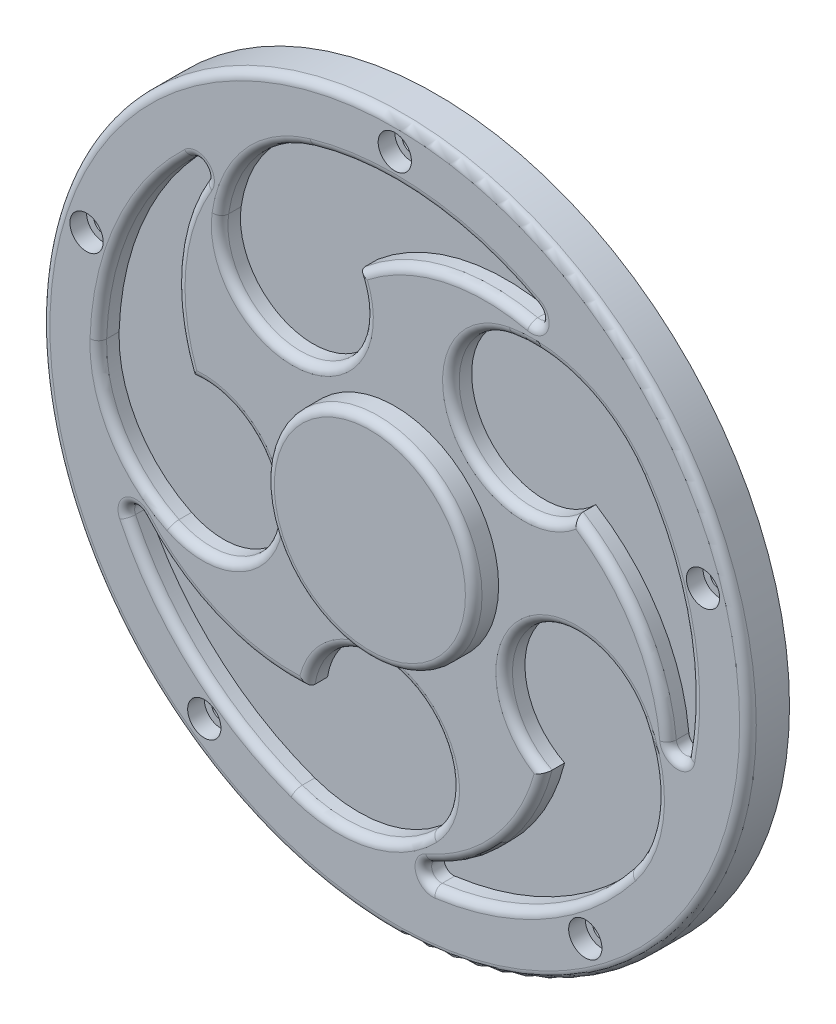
ISO-10303-21;
HEADER;
FILE_DESCRIPTION(('STEP AP214'),'2;1');
FILE_NAME('part.step','',(''),(''),'','','');
FILE_SCHEMA(('AUTOMOTIVE_DESIGN { 1 0 10303 214 1 1 1 1 }'));
ENDSEC;
DATA;
#1=APPLICATION_CONTEXT('core data for automotive mechanical design processes');
#2=APPLICATION_PROTOCOL_DEFINITION('international standard','automotive_design',2000,#1);
#3=PRODUCT_CONTEXT('',#1,'mechanical');
#4=PRODUCT('Part','Part','',(#3));
#5=PRODUCT_RELATED_PRODUCT_CATEGORY('part','',(#4));
#6=PRODUCT_DEFINITION_FORMATION('','',#4);
#7=PRODUCT_DEFINITION_CONTEXT('part definition',#1,'design');
#8=PRODUCT_DEFINITION('design','',#6,#7);
#9=PRODUCT_DEFINITION_SHAPE('','',#8);
#10=(LENGTH_UNIT() NAMED_UNIT(*) SI_UNIT(.MILLI.,.METRE.));
#11=(NAMED_UNIT(*) PLANE_ANGLE_UNIT() SI_UNIT($,.RADIAN.));
#12=(NAMED_UNIT(*) SI_UNIT($,.STERADIAN.) SOLID_ANGLE_UNIT());
#13=UNCERTAINTY_MEASURE_WITH_UNIT(LENGTH_MEASURE(1.E-05),#10,'distance_accuracy_value','');
#14=(GEOMETRIC_REPRESENTATION_CONTEXT(3) GLOBAL_UNCERTAINTY_ASSIGNED_CONTEXT((#13)) GLOBAL_UNIT_ASSIGNED_CONTEXT((#10,
#11,#12)) REPRESENTATION_CONTEXT('',''));
#15=CARTESIAN_POINT('',(0.,0.,0.));
#16=DIRECTION('',(0.,0.,1.));
#17=DIRECTION('',(1.,0.,0.));
#18=AXIS2_PLACEMENT_3D('',#15,#16,#17);
#19=CARTESIAN_POINT('',(0.,0.,-10.));
#20=DIRECTION('',(0.,0.,1.));
#21=DIRECTION('',(1.,0.,0.));
#22=AXIS2_PLACEMENT_3D('',#19,#20,#21);
#23=CYLINDRICAL_SURFACE('',#22,85.);
#24=CARTESIAN_POINT('',(0.,0.,-2.));
#25=DIRECTION('',(0.,0.,1.));
#26=DIRECTION('',(1.,0.,0.));
#27=AXIS2_PLACEMENT_3D('',#24,#25,#26);
#28=CIRCLE('',#27,85.);
#29=CARTESIAN_POINT('',(85.,0.,-2.));
#30=VERTEX_POINT('',#29);
#31=EDGE_CURVE('E1570',#30,#30,#28,.F.);
#32=ORIENTED_EDGE('',*,*,#31,.T.);
#33=EDGE_LOOP('',(#32));
#34=FACE_BOUND('',#33,.T.);
#35=CARTESIAN_POINT('',(0.,0.,-10.));
#36=DIRECTION('',(0.,0.,1.));
#37=DIRECTION('',(1.,0.,0.));
#38=AXIS2_PLACEMENT_3D('',#35,#36,#37);
#39=CIRCLE('',#38,85.);
#40=CARTESIAN_POINT('',(85.,0.,-10.));
#41=VERTEX_POINT('',#40);
#42=EDGE_CURVE('E1970',#41,#41,#39,.T.);
#43=ORIENTED_EDGE('',*,*,#42,.T.);
#44=EDGE_LOOP('',(#43));
#45=FACE_BOUND('',#44,.T.);
#46=ADVANCED_FACE('F48',(#34,#45),#23,.T.);
#47=CARTESIAN_POINT('',(0.,0.,-10.));
#48=DIRECTION('',(0.,0.,1.));
#49=DIRECTION('',(1.,0.,0.));
#50=AXIS2_PLACEMENT_3D('',#47,#48,#49);
#51=PLANE('',#50);
#52=CARTESIAN_POINT('',(0.,78.,-10.));
#53=DIRECTION('',(0.,0.,1.));
#54=DIRECTION('',(1.,0.,0.));
#55=AXIS2_PLACEMENT_3D('',#52,#53,#54);
#56=CIRCLE('',#55,2.25);
#57=CARTESIAN_POINT('',(2.25,78.,-10.));
#58=VERTEX_POINT('',#57);
#59=EDGE_CURVE('E1889',#58,#58,#56,.T.);
#60=ORIENTED_EDGE('',*,*,#59,.T.);
#61=EDGE_LOOP('',(#60));
#62=FACE_BOUND('',#61,.T.);
#63=CARTESIAN_POINT('',(74.1824082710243,24.1033255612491,-10.));
#64=DIRECTION('',(0.,0.,1.));
#65=DIRECTION('',(1.,0.,0.));
#66=AXIS2_PLACEMENT_3D('',#63,#64,#65);
#67=CIRCLE('',#66,2.25);
#68=CARTESIAN_POINT('',(76.4324082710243,24.1033255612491,-10.));
#69=VERTEX_POINT('',#68);
#70=EDGE_CURVE('E1871',#69,#69,#67,.T.);
#71=ORIENTED_EDGE('',*,*,#70,.T.);
#72=EDGE_LOOP('',(#71));
#73=FACE_BOUND('',#72,.T.);
#74=CARTESIAN_POINT('',(45.8472496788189,-63.103325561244,-10.));
#75=DIRECTION('',(0.,0.,1.));
#76=DIRECTION('',(1.,0.,0.));
#77=AXIS2_PLACEMENT_3D('',#74,#75,#76);
#78=CIRCLE('',#77,2.25);
#79=CARTESIAN_POINT('',(48.0972496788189,-63.103325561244,-10.));
#80=VERTEX_POINT('',#79);
#81=EDGE_CURVE('E1853',#80,#80,#78,.T.);
#82=ORIENTED_EDGE('',*,*,#81,.T.);
#83=EDGE_LOOP('',(#82));
#84=FACE_BOUND('',#83,.T.);
#85=CARTESIAN_POINT('',(-45.8472496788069,-63.1033255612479,-10.));
#86=DIRECTION('',(0.,0.,1.));
#87=DIRECTION('',(1.,0.,0.));
#88=AXIS2_PLACEMENT_3D('',#85,#86,#87);
#89=CIRCLE('',#88,2.25);
#90=CARTESIAN_POINT('',(-43.5972496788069,-63.1033255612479,-10.));
#91=VERTEX_POINT('',#90);
#92=EDGE_CURVE('E1823',#91,#91,#89,.T.);
#93=ORIENTED_EDGE('',*,*,#92,.T.);
#94=EDGE_LOOP('',(#93));
#95=FACE_BOUND('',#94,.T.);
#96=CARTESIAN_POINT('',(-74.1824082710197,24.1033255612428,-10.));
#97=DIRECTION('',(0.,0.,1.));
#98=DIRECTION('',(1.,0.,0.));
#99=AXIS2_PLACEMENT_3D('',#96,#97,#98);
#100=CIRCLE('',#99,2.25);
#101=CARTESIAN_POINT('',(-71.9324082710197,24.1033255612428,-10.));
#102=VERTEX_POINT('',#101);
#103=EDGE_CURVE('E321',#102,#102,#100,.T.);
#104=ORIENTED_EDGE('',*,*,#103,.T.);
#105=EDGE_LOOP('',(#104));
#106=FACE_BOUND('',#105,.T.);
#107=ORIENTED_EDGE('',*,*,#42,.F.);
#108=EDGE_LOOP('',(#107));
#109=FACE_BOUND('',#108,.T.);
#110=ADVANCED_FACE('F832',(#62,#73,#84,#95,#106,#109),#51,.F.);
#111=CARTESIAN_POINT('',(0.,0.,0.));
#112=DIRECTION('',(0.,0.,1.));
#113=DIRECTION('',(1.,0.,0.));
#114=AXIS2_PLACEMENT_3D('',#111,#112,#113);
#115=PLANE('',#114);
#116=CARTESIAN_POINT('',(0.,78.,0.));
#117=DIRECTION('',(0.,0.,1.));
#118=DIRECTION('',(1.,0.,0.));
#119=AXIS2_PLACEMENT_3D('',#116,#117,#118);
#120=CIRCLE('',#119,3.99999999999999);
#121=CARTESIAN_POINT('',(3.99999999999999,78.,0.));
#122=VERTEX_POINT('',#121);
#123=EDGE_CURVE('E1900',#122,#122,#120,.T.);
#124=ORIENTED_EDGE('',*,*,#123,.F.);
#125=EDGE_LOOP('',(#124));
#126=FACE_BOUND('',#125,.T.);
#127=CARTESIAN_POINT('',(74.1824082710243,24.1033255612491,0.));
#128=DIRECTION('',(0.,0.,1.));
#129=DIRECTION('',(1.,0.,0.));
#130=AXIS2_PLACEMENT_3D('',#127,#128,#129);
#131=CIRCLE('',#130,3.99999999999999);
#132=CARTESIAN_POINT('',(78.1824082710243,24.1033255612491,0.));
#133=VERTEX_POINT('',#132);
#134=EDGE_CURVE('E1882',#133,#133,#131,.T.);
#135=ORIENTED_EDGE('',*,*,#134,.F.);
#136=EDGE_LOOP('',(#135));
#137=FACE_BOUND('',#136,.T.);
#138=CARTESIAN_POINT('',(45.8472496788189,-63.103325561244,0.));
#139=DIRECTION('',(0.,0.,1.));
#140=DIRECTION('',(1.,0.,0.));
#141=AXIS2_PLACEMENT_3D('',#138,#139,#140);
#142=CIRCLE('',#141,4.);
#143=CARTESIAN_POINT('',(49.8472496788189,-63.103325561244,0.));
#144=VERTEX_POINT('',#143);
#145=EDGE_CURVE('E1864',#144,#144,#142,.T.);
#146=ORIENTED_EDGE('',*,*,#145,.F.);
#147=EDGE_LOOP('',(#146));
#148=FACE_BOUND('',#147,.T.);
#149=CARTESIAN_POINT('',(-45.8472496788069,-63.1033255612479,0.));
#150=DIRECTION('',(0.,0.,1.));
#151=DIRECTION('',(1.,0.,0.));
#152=AXIS2_PLACEMENT_3D('',#149,#150,#151);
#153=CIRCLE('',#152,4.);
#154=CARTESIAN_POINT('',(-41.8472496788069,-63.1033255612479,0.));
#155=VERTEX_POINT('',#154);
#156=EDGE_CURVE('E1846',#155,#155,#153,.T.);
#157=ORIENTED_EDGE('',*,*,#156,.F.);
#158=EDGE_LOOP('',(#157));
#159=FACE_BOUND('',#158,.T.);
#160=CARTESIAN_POINT('',(-74.1824082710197,24.1033255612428,0.));
#161=DIRECTION('',(0.,0.,1.));
#162=DIRECTION('',(1.,0.,0.));
#163=AXIS2_PLACEMENT_3D('',#160,#161,#162);
#164=CIRCLE('',#163,3.99999999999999);
#165=CARTESIAN_POINT('',(-70.1824082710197,24.1033255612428,0.));
#166=VERTEX_POINT('',#165);
#167=EDGE_CURVE('E1820',#166,#166,#164,.T.);
#168=ORIENTED_EDGE('',*,*,#167,.F.);
#169=EDGE_LOOP('',(#168));
#170=FACE_BOUND('',#169,.T.);
#171=CARTESIAN_POINT('',(9.12494916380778,-68.5345555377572,0.));
#172=DIRECTION('',(0.,0.,1.));
#173=DIRECTION('',(1.,0.,0.));
#174=AXIS2_PLACEMENT_3D('',#171,#172,#173);
#175=CIRCLE('',#174,4.25000000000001);
#176=CARTESIAN_POINT('',(9.68586032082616,-72.7473786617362,0.));
#177=VERTEX_POINT('',#176);
#178=CARTESIAN_POINT('',(7.44755199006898,-64.6295793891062,0.));
#179=VERTEX_POINT('',#178);
#180=EDGE_CURVE('E767',#177,#179,#175,.F.);
#181=ORIENTED_EDGE('',*,*,#180,.T.);
#182=CARTESIAN_POINT('',(-10.707805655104,-22.3639551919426,0.));
#183=DIRECTION('',(0.,0.,1.));
#184=DIRECTION('',(1.,0.,0.));
#185=AXIS2_PLACEMENT_3D('',#182,#183,#184);
#186=CIRCLE('',#185,46.);
#187=CARTESIAN_POINT('',(33.542208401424,-34.9312244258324,0.));
#188=VERTEX_POINT('',#187);
#189=EDGE_CURVE('E701',#179,#188,#186,.T.);
#190=ORIENTED_EDGE('',*,*,#189,.T.);
#191=CARTESIAN_POINT('',(43.8175614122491,-18.3581402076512,0.));
#192=DIRECTION('',(0.,0.,1.));
#193=DIRECTION('',(1.,0.,0.));
#194=AXIS2_PLACEMENT_3D('',#191,#192,#193);
#195=CIRCLE('',#194,19.5);
#196=CARTESIAN_POINT('',(61.0350394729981,-9.20344473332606,0.));
#197=VERTEX_POINT('',#196);
#198=EDGE_CURVE('E764',#188,#197,#195,.F.);
#199=ORIENTED_EDGE('',*,*,#198,.T.);
#200=CARTESIAN_POINT('',(31.8247557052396,-24.7348281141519,0.));
#201=DIRECTION('',(0.,0.,1.));
#202=DIRECTION('',(1.,0.,0.));
#203=AXIS2_PLACEMENT_3D('',#200,#201,#202);
#204=CIRCLE('',#203,33.0826925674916);
#205=CARTESIAN_POINT('',(57.9457149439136,-45.036553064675,0.));
#206=VERTEX_POINT('',#205);
#207=EDGE_CURVE('E762',#197,#206,#204,.F.);
#208=ORIENTED_EDGE('',*,*,#207,.T.);
#209=CARTESIAN_POINT('',(0.,0.,0.));
#210=DIRECTION('',(0.,0.,1.));
#211=DIRECTION('',(1.,0.,0.));
#212=AXIS2_PLACEMENT_3D('',#209,#210,#211);
#213=CIRCLE('',#212,73.3893520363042);
#214=EDGE_CURVE('E766',#206,#177,#213,.F.);
#215=ORIENTED_EDGE('',*,*,#214,.T.);
#216=EDGE_LOOP('',(#181,#190,#199,#208,#215));
#217=FACE_BOUND('',#216,.T.);
#218=CARTESIAN_POINT('',(-62.3604712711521,-29.8566847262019,0.));
#219=DIRECTION('',(0.,0.,1.));
#220=DIRECTION('',(1.,0.,0.));
#221=AXIS2_PLACEMENT_3D('',#218,#219,#220);
#222=CIRCLE('',#221,4.25000000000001);
#223=CARTESIAN_POINT('',(-66.1937730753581,-31.6919768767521,0.));
#224=VERTEX_POINT('',#223);
#225=CARTESIAN_POINT('',(-59.1649624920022,-27.0546812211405,0.));
#226=VERTEX_POINT('',#225);
#227=EDGE_CURVE('E410',#224,#226,#222,.F.);
#228=ORIENTED_EDGE('',*,*,#227,.T.);
#229=CARTESIAN_POINT('',(-24.5782792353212,3.2728861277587,0.));
#230=DIRECTION('',(0.,0.,1.));
#231=DIRECTION('',(1.,0.,0.));
#232=AXIS2_PLACEMENT_3D('',#229,#230,#231);
#233=CIRCLE('',#232,46.);
#234=CARTESIAN_POINT('',(-22.8564561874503,-42.6948778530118,0.));
#235=VERTEX_POINT('',#234);
#236=EDGE_CURVE('E412',#226,#235,#233,.T.);
#237=ORIENTED_EDGE('',*,*,#236,.T.);
#238=CARTESIAN_POINT('',(-3.91925774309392,-47.3459546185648,0.));
#239=DIRECTION('',(0.,0.,1.));
#240=DIRECTION('',(1.,0.,0.));
#241=AXIS2_PLACEMENT_3D('',#238,#239,#240);
#242=CIRCLE('',#241,19.5);
#243=CARTESIAN_POINT('',(10.1078683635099,-60.8917928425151,0.));
#244=VERTEX_POINT('',#243);
#245=EDGE_CURVE('E406',#235,#244,#242,.F.);
#246=ORIENTED_EDGE('',*,*,#245,.T.);
#247=CARTESIAN_POINT('',(-13.6898291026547,-37.9106235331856,0.));
#248=DIRECTION('',(0.,0.,1.));
#249=DIRECTION('',(1.,0.,0.));
#250=AXIS2_PLACEMENT_3D('',#247,#248,#249);
#251=CIRCLE('',#250,33.0826925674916);
#252=CARTESIAN_POINT('',(-24.9260965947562,-69.0267100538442,0.));
#253=VERTEX_POINT('',#252);
#254=EDGE_CURVE('E404',#244,#253,#251,.F.);
#255=ORIENTED_EDGE('',*,*,#254,.T.);
#256=CARTESIAN_POINT('',(0.,0.,0.));
#257=DIRECTION('',(0.,0.,1.));
#258=DIRECTION('',(1.,0.,0.));
#259=AXIS2_PLACEMENT_3D('',#256,#257,#258);
#260=CIRCLE('',#259,73.3893520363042);
#261=EDGE_CURVE('E408',#253,#224,#260,.F.);
#262=ORIENTED_EDGE('',*,*,#261,.T.);
#263=EDGE_LOOP('',(#228,#237,#246,#255,#262));
#264=FACE_BOUND('',#263,.T.);
#265=CARTESIAN_POINT('',(-47.6658399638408,50.0821095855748,0.));
#266=DIRECTION('',(0.,0.,1.));
#267=DIRECTION('',(1.,0.,0.));
#268=AXIS2_PLACEMENT_3D('',#265,#266,#267);
#269=CIRCLE('',#268,4.25000000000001);
#270=CARTESIAN_POINT('',(-50.5958619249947,53.1606597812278,0.));
#271=VERTEX_POINT('',#270);
#272=CARTESIAN_POINT('',(-44.0135097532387,47.908866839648,0.));
#273=VERTEX_POINT('',#272);
#274=EDGE_CURVE('E355',#271,#273,#269,.F.);
#275=ORIENTED_EDGE('',*,*,#274,.T.);
#276=CARTESIAN_POINT('',(-4.48240629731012,24.3867100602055,0.));
#277=DIRECTION('',(0.,0.,1.));
#278=DIRECTION('',(1.,0.,0.));
#279=AXIS2_PLACEMENT_3D('',#276,#277,#278);
#280=CIRCLE('',#279,46.);
#281=CARTESIAN_POINT('',(-47.668275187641,8.54433876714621,0.));
#282=VERTEX_POINT('',#281);
#283=EDGE_CURVE('E349',#273,#282,#280,.T.);
#284=ORIENTED_EDGE('',*,*,#283,.T.);
#285=CARTESIAN_POINT('',(-46.2397959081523,-10.9032689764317,0.));
#286=DIRECTION('',(0.,0.,1.));
#287=DIRECTION('',(1.,0.,0.));
#288=AXIS2_PLACEMENT_3D('',#285,#286,#287);
#289=CIRCLE('',#288,19.5);
#290=CARTESIAN_POINT('',(-54.7880332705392,-28.4297528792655,0.));
#291=VERTEX_POINT('',#290);
#292=EDGE_CURVE('E653',#282,#291,#289,.F.);
#293=ORIENTED_EDGE('',*,*,#292,.T.);
#294=CARTESIAN_POINT('',(-40.2855353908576,1.3047742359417,0.));
#295=DIRECTION('',(0.,0.,1.));
#296=DIRECTION('',(1.,0.,0.));
#297=AXIS2_PLACEMENT_3D('',#294,#295,#296);
#298=CIRCLE('',#297,33.0826925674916);
#299=CARTESIAN_POINT('',(-73.3508898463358,2.37570011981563,0.));
#300=VERTEX_POINT('',#299);
#301=EDGE_CURVE('E651',#291,#300,#298,.F.);
#302=ORIENTED_EDGE('',*,*,#301,.T.);
#303=CARTESIAN_POINT('',(0.,0.,0.));
#304=DIRECTION('',(0.,0.,1.));
#305=DIRECTION('',(1.,0.,0.));
#306=AXIS2_PLACEMENT_3D('',#303,#304,#305);
#307=CIRCLE('',#306,73.3893520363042);
#308=EDGE_CURVE('E654',#300,#271,#307,.F.);
#309=ORIENTED_EDGE('',*,*,#308,.T.);
#310=EDGE_LOOP('',(#275,#284,#293,#302,#309));
#311=FACE_BOUND('',#310,.T.);
#312=CARTESIAN_POINT('',(32.9013620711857,60.8091306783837,0.));
#313=DIRECTION('',(0.,0.,1.));
#314=DIRECTION('',(1.,0.,0.));
#315=AXIS2_PLACEMENT_3D('',#312,#313,#314);
#316=CIRCLE('',#315,4.25000000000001);
#317=CARTESIAN_POINT('',(34.9238107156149,64.5470714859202,0.));
#318=VERTEX_POINT('',#317);
#319=CARTESIAN_POINT('',(31.9631175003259,56.6639892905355,0.));
#320=VERTEX_POINT('',#319);
#321=EDGE_CURVE('E605',#318,#320,#316,.F.);
#322=ORIENTED_EDGE('',*,*,#321,.T.);
#323=CARTESIAN_POINT('',(21.807999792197,11.7989295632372,0.));
#324=DIRECTION('',(0.,0.,1.));
#325=DIRECTION('',(1.,0.,0.));
#326=AXIS2_PLACEMENT_3D('',#323,#324,#325);
#327=CIRCLE('',#326,46.);
#328=CARTESIAN_POINT('',(-6.60415806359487,47.9755696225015,0.));
#329=VERTEX_POINT('',#328);
#330=EDGE_CURVE('E606',#320,#329,#327,.T.);
#331=ORIENTED_EDGE('',*,*,#330,.T.);
#332=CARTESIAN_POINT('',(-24.6585077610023,40.6073638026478,0.));
#333=DIRECTION('',(0.,0.,1.));
#334=DIRECTION('',(1.,0.,0.));
#335=AXIS2_PLACEMENT_3D('',#332,#333,#334);
#336=CIRCLE('',#335,19.5);
#337=CARTESIAN_POINT('',(-43.9687351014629,43.321239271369,0.));
#338=VERTEX_POINT('',#337);
#339=EDGE_CURVE('E601',#329,#338,#336,.F.);
#340=ORIENTED_EDGE('',*,*,#339,.T.);
#341=CARTESIAN_POINT('',(-11.2080010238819,38.7170183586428,0.));
#342=DIRECTION('',(0.,0.,1.));
#343=DIRECTION('',(1.,0.,0.));
#344=AXIS2_PLACEMENT_3D('',#341,#342,#343);
#345=CIRCLE('',#344,33.0826925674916);
#346=CARTESIAN_POINT('',(-20.4072464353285,70.4949734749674,0.));
#347=VERTEX_POINT('',#346);
#348=EDGE_CURVE('E599',#338,#347,#345,.F.);
#349=ORIENTED_EDGE('',*,*,#348,.T.);
#350=CARTESIAN_POINT('',(0.,0.,0.));
#351=DIRECTION('',(0.,0.,1.));
#352=DIRECTION('',(1.,0.,0.));
#353=AXIS2_PLACEMENT_3D('',#350,#351,#352);
#354=CIRCLE('',#353,73.3893520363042);
#355=EDGE_CURVE('E603',#347,#318,#354,.F.);
#356=ORIENTED_EDGE('',*,*,#355,.T.);
#357=EDGE_LOOP('',(#322,#331,#340,#349,#356));
#358=FACE_BOUND('',#357,.T.);
#359=CARTESIAN_POINT('',(68.,-12.5,0.));
#360=DIRECTION('',(0.,0.,1.));
#361=DIRECTION('',(1.,0.,0.));
#362=AXIS2_PLACEMENT_3D('',#359,#360,#361);
#363=CIRCLE('',#362,4.25000000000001);
#364=CARTESIAN_POINT('',(72.1799639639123,-13.2683757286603,0.));
#365=VERTEX_POINT('',#364);
#366=CARTESIAN_POINT('',(63.7678027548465,-12.8885955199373,0.));
#367=VERTEX_POINT('',#366);
#368=EDGE_CURVE('E551',#365,#367,#363,.F.);
#369=ORIENTED_EDGE('',*,*,#368,.T.);
#370=CARTESIAN_POINT('',(17.9604913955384,-17.0945705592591,0.));
#371=DIRECTION('',(0.,0.,1.));
#372=DIRECTION('',(1.,0.,0.));
#373=AXIS2_PLACEMENT_3D('',#370,#371,#372);
#374=CIRCLE('',#373,46.);
#375=CARTESIAN_POINT('',(43.5866810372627,21.1061938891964,0.));
#376=VERTEX_POINT('',#375);
#377=EDGE_CURVE('E545',#367,#376,#374,.T.);
#378=ORIENTED_EDGE('',*,*,#377,.T.);
#379=CARTESIAN_POINT('',(31.,36.,0.));
#380=DIRECTION('',(0.,0.,1.));
#381=DIRECTION('',(1.,0.,0.));
#382=AXIS2_PLACEMENT_3D('',#379,#380,#381);
#383=CIRCLE('',#382,19.5);
#384=CARTESIAN_POINT('',(27.6138605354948,55.2037511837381,0.));
#385=VERTEX_POINT('',#384);
#386=EDGE_CURVE('E1946',#376,#385,#383,.F.);
#387=ORIENTED_EDGE('',*,*,#386,.T.);
#388=CARTESIAN_POINT('',(33.3586098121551,22.623659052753,0.));
#389=DIRECTION('',(0.,0.,1.));
#390=DIRECTION('',(1.,0.,0.));
#391=AXIS2_PLACEMENT_3D('',#388,#389,#390);
#392=CIRCLE('',#391,33.0826925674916);
#393=CARTESIAN_POINT('',(60.7385179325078,41.1925895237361,0.));
#394=VERTEX_POINT('',#393);
#395=EDGE_CURVE('E1944',#385,#394,#392,.F.);
#396=ORIENTED_EDGE('',*,*,#395,.T.);
#397=CARTESIAN_POINT('',(0.,0.,0.));
#398=DIRECTION('',(0.,0.,1.));
#399=DIRECTION('',(1.,0.,0.));
#400=AXIS2_PLACEMENT_3D('',#397,#398,#399);
#401=CIRCLE('',#400,73.3893520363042);
#402=EDGE_CURVE('E1947',#394,#365,#401,.F.);
#403=ORIENTED_EDGE('',*,*,#402,.T.);
#404=EDGE_LOOP('',(#369,#378,#387,#396,#403));
#405=FACE_BOUND('',#404,.T.);
#406=CARTESIAN_POINT('',(0.,0.,0.));
#407=DIRECTION('',(0.,0.,1.));
#408=DIRECTION('',(1.,0.,0.));
#409=AXIS2_PLACEMENT_3D('',#406,#407,#408);
#410=CIRCLE('',#409,83.);
#411=CARTESIAN_POINT('',(83.,0.,0.));
#412=VERTEX_POINT('',#411);
#413=EDGE_CURVE('E1564',#412,#412,#410,.T.);
#414=ORIENTED_EDGE('',*,*,#413,.T.);
#415=EDGE_LOOP('',(#414));
#416=FACE_BOUND('',#415,.T.);
#417=CARTESIAN_POINT('',(0.,0.,0.));
#418=DIRECTION('',(0.,0.,1.));
#419=DIRECTION('',(1.,0.,0.));
#420=AXIS2_PLACEMENT_3D('',#417,#418,#419);
#421=CIRCLE('',#420,25.);
#422=CARTESIAN_POINT('',(25.,0.,0.));
#423=VERTEX_POINT('',#422);
#424=EDGE_CURVE('E1571',#423,#423,#421,.T.);
#425=ORIENTED_EDGE('',*,*,#424,.F.);
#426=EDGE_LOOP('',(#425));
#427=FACE_BOUND('',#426,.T.);
#428=ADVANCED_FACE('F660',(#126,#137,#148,#159,#170,#217,#264,#311,#358,#405,#416,#427),#115,.T.);
#429=CARTESIAN_POINT('',(0.,0.,6.));
#430=DIRECTION('',(0.,0.,-1.));
#431=DIRECTION('',(-1.,0.,0.));
#432=AXIS2_PLACEMENT_3D('',#429,#430,#431);
#433=CYLINDRICAL_SURFACE('',#432,25.);
#434=CARTESIAN_POINT('',(0.,0.,4.));
#435=DIRECTION('',(0.,0.,1.));
#436=DIRECTION('',(1.,0.,0.));
#437=AXIS2_PLACEMENT_3D('',#434,#435,#436);
#438=CIRCLE('',#437,25.);
#439=CARTESIAN_POINT('',(25.,0.,4.));
#440=VERTEX_POINT('',#439);
#441=EDGE_CURVE('E1938',#440,#440,#438,.F.);
#442=ORIENTED_EDGE('',*,*,#441,.T.);
#443=EDGE_LOOP('',(#442));
#444=FACE_BOUND('',#443,.T.);
#445=ORIENTED_EDGE('',*,*,#424,.T.);
#446=EDGE_LOOP('',(#445));
#447=FACE_BOUND('',#446,.T.);
#448=ADVANCED_FACE('F1222',(#444,#447),#433,.T.);
#449=CARTESIAN_POINT('',(0.,0.,6.));
#450=DIRECTION('',(0.,0.,1.));
#451=DIRECTION('',(1.,0.,0.));
#452=AXIS2_PLACEMENT_3D('',#449,#450,#451);
#453=PLANE('',#452);
#454=CARTESIAN_POINT('',(0.,0.,6.));
#455=DIRECTION('',(0.,0.,1.));
#456=DIRECTION('',(1.,0.,0.));
#457=AXIS2_PLACEMENT_3D('',#454,#455,#456);
#458=CIRCLE('',#457,23.);
#459=CARTESIAN_POINT('',(23.,0.,6.));
#460=VERTEX_POINT('',#459);
#461=EDGE_CURVE('E1933',#460,#460,#458,.T.);
#462=ORIENTED_EDGE('',*,*,#461,.T.);
#463=EDGE_LOOP('',(#462));
#464=FACE_BOUND('',#463,.T.);
#465=ADVANCED_FACE('F848',(#464),#453,.T.);
#466=CARTESIAN_POINT('',(0.,0.,-2.));
#467=DIRECTION('',(0.,0.,1.));
#468=DIRECTION('',(1.,0.,0.));
#469=AXIS2_PLACEMENT_3D('',#466,#467,#468);
#470=TOROIDAL_SURFACE('',#469,83.,2.);
#471=ORIENTED_EDGE('',*,*,#31,.F.);
#472=EDGE_LOOP('',(#471));
#473=FACE_BOUND('',#472,.T.);
#474=ORIENTED_EDGE('',*,*,#413,.F.);
#475=EDGE_LOOP('',(#474));
#476=FACE_BOUND('',#475,.T.);
#477=ADVANCED_FACE('F844',(#473,#476),#470,.T.);
#478=CARTESIAN_POINT('',(0.,0.,4.));
#479=DIRECTION('',(0.,0.,1.));
#480=DIRECTION('',(1.,0.,0.));
#481=AXIS2_PLACEMENT_3D('',#478,#479,#480);
#482=TOROIDAL_SURFACE('',#481,23.,2.);
#483=ORIENTED_EDGE('',*,*,#441,.F.);
#484=EDGE_LOOP('',(#483));
#485=FACE_BOUND('',#484,.T.);
#486=ORIENTED_EDGE('',*,*,#461,.F.);
#487=EDGE_LOOP('',(#486));
#488=FACE_BOUND('',#487,.T.);
#489=ADVANCED_FACE('F847',(#485,#488),#482,.T.);
#490=CARTESIAN_POINT('',(68.,-12.5,-5.));
#491=DIRECTION('',(0.,0.,1.));
#492=DIRECTION('',(1.,0.,0.));
#493=AXIS2_PLACEMENT_3D('',#490,#491,#492);
#494=CYLINDRICAL_SURFACE('',#493,2.25000000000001);
#495=DIRECTION('',(0.,0.,1.));
#496=VECTOR('',#495,1.);
#497=CARTESIAN_POINT('',(65.7594249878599,-12.7057270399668,-5.));
#498=LINE('',#497,#496);
#499=CARTESIAN_POINT('',(65.7594249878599,-12.7057270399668,-5.));
#500=VERTEX_POINT('',#499);
#501=CARTESIAN_POINT('',(65.7594249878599,-12.7057270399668,-2.));
#502=VERTEX_POINT('',#501);
#503=EDGE_CURVE('E1965',#500,#502,#498,.T.);
#504=ORIENTED_EDGE('',*,*,#503,.T.);
#505=CARTESIAN_POINT('',(68.,-12.5,-2.));
#506=DIRECTION('',(0.,0.,1.));
#507=DIRECTION('',(1.,0.,0.));
#508=AXIS2_PLACEMENT_3D('',#505,#506,#507);
#509=CIRCLE('',#508,2.25000000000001);
#510=CARTESIAN_POINT('',(70.2129220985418,-12.9067871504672,-2.));
#511=VERTEX_POINT('',#510);
#512=EDGE_CURVE('E550',#502,#511,#509,.T.);
#513=ORIENTED_EDGE('',*,*,#512,.T.);
#514=DIRECTION('',(0.,0.,1.));
#515=VECTOR('',#514,1.);
#516=CARTESIAN_POINT('',(70.2129220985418,-12.9067871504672,-5.));
#517=LINE('',#516,#515);
#518=CARTESIAN_POINT('',(70.2129220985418,-12.9067871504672,-5.));
#519=VERTEX_POINT('',#518);
#520=EDGE_CURVE('E1988',#519,#511,#517,.T.);
#521=ORIENTED_EDGE('',*,*,#520,.F.);
#522=CARTESIAN_POINT('',(68.,-12.5,-5.));
#523=DIRECTION('',(0.,0.,1.));
#524=DIRECTION('',(-1.,0.,0.));
#525=AXIS2_PLACEMENT_3D('',#522,#523,#524);
#526=CIRCLE('',#525,2.25000000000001);
#527=EDGE_CURVE('E594',#500,#519,#526,.T.);
#528=ORIENTED_EDGE('',*,*,#527,.F.);
#529=EDGE_LOOP('',(#504,#513,#521,#528));
#530=FACE_BOUND('',#529,.T.);
#531=ADVANCED_FACE('F851',(#530),#494,.F.);
#532=CARTESIAN_POINT('',(17.9604913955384,-17.0945705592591,-5.));
#533=DIRECTION('',(0.,0.,1.));
#534=DIRECTION('',(1.,0.,0.));
#535=AXIS2_PLACEMENT_3D('',#532,#533,#534);
#536=CYLINDRICAL_SURFACE('',#535,48.);
#537=DIRECTION('',(0.,0.,1.));
#538=VECTOR('',#537,1.);
#539=CARTESIAN_POINT('',(43.3743686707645,23.6256313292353,-5.));
#540=LINE('',#539,#538);
#541=CARTESIAN_POINT('',(43.3743686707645,23.6256313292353,-5.));
#542=VERTEX_POINT('',#541);
#543=CARTESIAN_POINT('',(43.3743686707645,23.6256313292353,-2.));
#544=VERTEX_POINT('',#543);
#545=EDGE_CURVE('E1967',#542,#544,#540,.T.);
#546=ORIENTED_EDGE('',*,*,#545,.T.);
#547=CARTESIAN_POINT('',(17.9604913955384,-17.0945705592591,-2.));
#548=DIRECTION('',(0.,0.,1.));
#549=DIRECTION('',(1.,0.,0.));
#550=AXIS2_PLACEMENT_3D('',#547,#548,#549);
#551=CIRCLE('',#550,48.);
#552=EDGE_CURVE('E1941',#544,#502,#551,.F.);
#553=ORIENTED_EDGE('',*,*,#552,.T.);
#554=ORIENTED_EDGE('',*,*,#503,.F.);
#555=CARTESIAN_POINT('',(17.9604913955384,-17.0945705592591,-5.));
#556=DIRECTION('',(0.,0.,-1.));
#557=DIRECTION('',(-1.,0.,0.));
#558=AXIS2_PLACEMENT_3D('',#555,#556,#557);
#559=CIRCLE('',#558,48.);
#560=EDGE_CURVE('E1977',#542,#500,#559,.T.);
#561=ORIENTED_EDGE('',*,*,#560,.F.);
#562=EDGE_LOOP('',(#546,#553,#554,#561));
#563=FACE_BOUND('',#562,.T.);
#564=ADVANCED_FACE('F1264',(#563),#536,.T.);
#565=CARTESIAN_POINT('',(31.,36.,-5.));
#566=DIRECTION('',(0.,0.,1.));
#567=DIRECTION('',(1.,0.,0.));
#568=AXIS2_PLACEMENT_3D('',#565,#566,#567);
#569=CYLINDRICAL_SURFACE('',#568,17.5);
#570=DIRECTION('',(0.,0.,1.));
#571=VECTOR('',#570,1.);
#572=CARTESIAN_POINT('',(27.9611568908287,53.2341356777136,-5.));
#573=LINE('',#572,#571);
#574=CARTESIAN_POINT('',(27.9611568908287,53.2341356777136,-5.));
#575=VERTEX_POINT('',#574);
#576=CARTESIAN_POINT('',(27.9611568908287,53.2341356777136,-2.));
#577=VERTEX_POINT('',#576);
#578=EDGE_CURVE('E1974',#575,#577,#573,.T.);
#579=ORIENTED_EDGE('',*,*,#578,.T.);
#580=CARTESIAN_POINT('',(31.,36.,-2.));
#581=DIRECTION('',(0.,0.,1.));
#582=DIRECTION('',(1.,0.,0.));
#583=AXIS2_PLACEMENT_3D('',#580,#581,#582);
#584=CIRCLE('',#583,17.5);
#585=EDGE_CURVE('E572',#577,#544,#584,.T.);
#586=ORIENTED_EDGE('',*,*,#585,.T.);
#587=ORIENTED_EDGE('',*,*,#545,.F.);
#588=CARTESIAN_POINT('',(31.,36.,-5.));
#589=DIRECTION('',(0.,0.,1.));
#590=DIRECTION('',(1.,0.,0.));
#591=AXIS2_PLACEMENT_3D('',#588,#589,#590);
#592=CIRCLE('',#591,17.5);
#593=EDGE_CURVE('E2038',#575,#542,#592,.T.);
#594=ORIENTED_EDGE('',*,*,#593,.F.);
#595=EDGE_LOOP('',(#579,#586,#587,#594));
#596=FACE_BOUND('',#595,.T.);
#597=ADVANCED_FACE('F1274',(#596),#569,.F.);
#598=CARTESIAN_POINT('',(33.3586098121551,22.623659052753,-5.));
#599=DIRECTION('',(0.,0.,1.));
#600=DIRECTION('',(1.,0.,0.));
#601=AXIS2_PLACEMENT_3D('',#598,#599,#600);
#602=CYLINDRICAL_SURFACE('',#601,31.0826925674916);
#603=DIRECTION('',(0.,0.,1.));
#604=VECTOR('',#603,1.);
#605=CARTESIAN_POINT('',(59.083277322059,40.0700127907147,-5.));
#606=LINE('',#605,#604);
#607=CARTESIAN_POINT('',(59.083277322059,40.0700127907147,-5.));
#608=VERTEX_POINT('',#607);
#609=CARTESIAN_POINT('',(59.083277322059,40.0700127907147,-2.));
#610=VERTEX_POINT('',#609);
#611=EDGE_CURVE('E1990',#608,#610,#606,.T.);
#612=ORIENTED_EDGE('',*,*,#611,.T.);
#613=CARTESIAN_POINT('',(33.3586098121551,22.623659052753,-2.));
#614=DIRECTION('',(0.,0.,1.));
#615=DIRECTION('',(1.,0.,0.));
#616=AXIS2_PLACEMENT_3D('',#613,#614,#615);
#617=CIRCLE('',#616,31.0826925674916);
#618=EDGE_CURVE('E568',#610,#577,#617,.T.);
#619=ORIENTED_EDGE('',*,*,#618,.T.);
#620=ORIENTED_EDGE('',*,*,#578,.F.);
#621=CARTESIAN_POINT('',(33.3586098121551,22.623659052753,-5.));
#622=DIRECTION('',(0.,0.,1.));
#623=DIRECTION('',(-1.,0.,0.));
#624=AXIS2_PLACEMENT_3D('',#621,#622,#623);
#625=CIRCLE('',#624,31.0826925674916);
#626=EDGE_CURVE('E2047',#608,#575,#625,.T.);
#627=ORIENTED_EDGE('',*,*,#626,.F.);
#628=EDGE_LOOP('',(#612,#619,#620,#627));
#629=FACE_BOUND('',#628,.T.);
#630=ADVANCED_FACE('F1283',(#629),#602,.F.);
#631=CARTESIAN_POINT('',(0.,0.,-5.));
#632=DIRECTION('',(0.,0.,1.));
#633=DIRECTION('',(1.,0.,0.));
#634=AXIS2_PLACEMENT_3D('',#631,#632,#633);
#635=CYLINDRICAL_SURFACE('',#634,71.3893520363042);
#636=ORIENTED_EDGE('',*,*,#520,.T.);
#637=CARTESIAN_POINT('',(0.,0.,-2.));
#638=DIRECTION('',(0.,0.,1.));
#639=DIRECTION('',(1.,0.,0.));
#640=AXIS2_PLACEMENT_3D('',#637,#638,#639);
#641=CIRCLE('',#640,71.3893520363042);
#642=EDGE_CURVE('E555',#511,#610,#641,.T.);
#643=ORIENTED_EDGE('',*,*,#642,.T.);
#644=ORIENTED_EDGE('',*,*,#611,.F.);
#645=CARTESIAN_POINT('',(0.,0.,-5.));
#646=DIRECTION('',(0.,0.,1.));
#647=DIRECTION('',(-1.,0.,0.));
#648=AXIS2_PLACEMENT_3D('',#645,#646,#647);
#649=CIRCLE('',#648,71.3893520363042);
#650=EDGE_CURVE('E2049',#519,#608,#649,.T.);
#651=ORIENTED_EDGE('',*,*,#650,.F.);
#652=EDGE_LOOP('',(#636,#643,#644,#651));
#653=FACE_BOUND('',#652,.T.);
#654=ADVANCED_FACE('F1290',(#653),#635,.F.);
#655=CARTESIAN_POINT('',(42.9802456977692,-14.7972852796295,-5.));
#656=DIRECTION('',(0.,0.,-1.));
#657=DIRECTION('',(-1.,0.,0.));
#658=AXIS2_PLACEMENT_3D('',#655,#656,#657);
#659=PLANE('',#658);
#660=ORIENTED_EDGE('',*,*,#527,.T.);
#661=ORIENTED_EDGE('',*,*,#650,.T.);
#662=ORIENTED_EDGE('',*,*,#626,.T.);
#663=ORIENTED_EDGE('',*,*,#593,.T.);
#664=ORIENTED_EDGE('',*,*,#560,.T.);
#665=EDGE_LOOP('',(#660,#661,#662,#663,#664));
#666=FACE_BOUND('',#665,.T.);
#667=ADVANCED_FACE('F873',(#666),#659,.F.);
#668=CARTESIAN_POINT('',(33.3586098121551,22.623659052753,-2.));
#669=DIRECTION('',(0.,0.,1.));
#670=DIRECTION('',(1.,0.,0.));
#671=AXIS2_PLACEMENT_3D('',#668,#669,#670);
#672=TOROIDAL_SURFACE('',#671,33.0826925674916,2.);
#673=CARTESIAN_POINT('',(27.6138605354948,55.2037511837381,-2.));
#674=DIRECTION('',(-0.984807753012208,-0.17364817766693,0.));
#675=DIRECTION('',(0.17364817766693,-0.984807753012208,0.));
#676=AXIS2_PLACEMENT_3D('',#673,#674,#675);
#677=CIRCLE('',#676,2.);
#678=EDGE_CURVE('E595',#577,#385,#677,.T.);
#679=ORIENTED_EDGE('',*,*,#678,.F.);
#680=ORIENTED_EDGE('',*,*,#618,.F.);
#681=CARTESIAN_POINT('',(60.7385179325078,41.1925895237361,-2.));
#682=DIRECTION('',(0.561288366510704,-0.82762030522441,0.));
#683=DIRECTION('',(0.82762030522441,0.561288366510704,0.));
#684=AXIS2_PLACEMENT_3D('',#681,#682,#683);
#685=CIRCLE('',#684,2.);
#686=EDGE_CURVE('E590',#394,#610,#685,.T.);
#687=ORIENTED_EDGE('',*,*,#686,.F.);
#688=ORIENTED_EDGE('',*,*,#395,.F.);
#689=EDGE_LOOP('',(#679,#680,#687,#688));
#690=FACE_BOUND('',#689,.T.);
#691=ADVANCED_FACE('F870',(#690),#672,.T.);
#692=CARTESIAN_POINT('',(0.,0.,-2.));
#693=DIRECTION('',(0.,0.,1.));
#694=DIRECTION('',(1.,0.,0.));
#695=AXIS2_PLACEMENT_3D('',#692,#693,#694);
#696=TOROIDAL_SURFACE('',#695,73.3893520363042,2.);
#697=ORIENTED_EDGE('',*,*,#686,.T.);
#698=ORIENTED_EDGE('',*,*,#642,.F.);
#699=CARTESIAN_POINT('',(72.1799639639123,-13.2683757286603,-2.));
#700=DIRECTION('',(-0.180794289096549,-0.983520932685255,0.));
#701=DIRECTION('',(0.983520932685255,-0.180794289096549,0.));
#702=AXIS2_PLACEMENT_3D('',#699,#700,#701);
#703=CIRCLE('',#702,2.);
#704=EDGE_CURVE('E1960',#365,#511,#703,.T.);
#705=ORIENTED_EDGE('',*,*,#704,.F.);
#706=ORIENTED_EDGE('',*,*,#402,.F.);
#707=EDGE_LOOP('',(#697,#698,#705,#706));
#708=FACE_BOUND('',#707,.T.);
#709=ADVANCED_FACE('F863',(#708),#696,.T.);
#710=CARTESIAN_POINT('',(31.,36.,-2.));
#711=DIRECTION('',(0.,0.,1.));
#712=DIRECTION('',(1.,0.,0.));
#713=AXIS2_PLACEMENT_3D('',#710,#711,#712);
#714=TOROIDAL_SURFACE('',#713,19.5,2.);
#715=ORIENTED_EDGE('',*,*,#678,.T.);
#716=ORIENTED_EDGE('',*,*,#386,.F.);
#717=CARTESIAN_POINT('',(43.3743686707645,23.6256313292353,-2.));
#718=CARTESIAN_POINT('',(43.374366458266,23.6256444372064,-1.95224660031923));
#719=CARTESIAN_POINT('',(43.3746165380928,23.6234609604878,-1.90450011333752));
#720=CARTESIAN_POINT('',(43.3756045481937,23.6148014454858,-1.8094290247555));
#721=CARTESIAN_POINT('',(43.376342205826,23.608327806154,-1.76210420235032));
#722=CARTESIAN_POINT('',(43.378282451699,23.5912431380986,-1.66853027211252));
#723=CARTESIAN_POINT('',(43.3794820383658,23.5806588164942,-1.62227622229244));
#724=CARTESIAN_POINT('',(43.382315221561,23.5555399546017,-1.53087702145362));
#725=CARTESIAN_POINT('',(43.3839488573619,23.5410050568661,-1.48573197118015));
#726=CARTESIAN_POINT('',(43.389439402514,23.4918602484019,-1.35259526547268));
#727=CARTESIAN_POINT('',(43.3938918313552,23.4516595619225,-1.26663382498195));
#728=CARTESIAN_POINT('',(43.4040285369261,23.3584774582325,-1.10200450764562));
#729=CARTESIAN_POINT('',(43.409714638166,23.3054770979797,-1.02334768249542));
#730=CARTESIAN_POINT('',(43.422417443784,23.1844260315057,-0.868608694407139));
#731=CARTESIAN_POINT('',(43.4295031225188,23.1155271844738,-0.793198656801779));
#732=CARTESIAN_POINT('',(43.4442455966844,22.9680733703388,-0.652666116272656));
#733=CARTESIAN_POINT('',(43.4519025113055,22.8895163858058,-0.587545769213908));
#734=CARTESIAN_POINT('',(43.4690576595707,22.7077289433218,-0.455221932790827));
#735=CARTESIAN_POINT('',(43.4786073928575,22.6027664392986,-0.390406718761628));
#736=CARTESIAN_POINT('',(43.4975602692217,22.38487828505,-0.275792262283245));
#737=CARTESIAN_POINT('',(43.506963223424,22.2719432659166,-0.22601106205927));
#738=CARTESIAN_POINT('',(43.527199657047,22.0162092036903,-0.132324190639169));
#739=CARTESIAN_POINT('',(43.5379166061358,21.8721350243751,-0.091871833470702));
#740=CARTESIAN_POINT('',(43.5581761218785,21.5797686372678,-0.0324167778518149));
#741=CARTESIAN_POINT('',(43.5677203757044,21.4314828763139,-0.0133829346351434));
#742=CARTESIAN_POINT('',(43.5798606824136,21.226941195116,-0.00183179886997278));
#743=CARTESIAN_POINT('',(43.5830692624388,21.171125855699,-0.000175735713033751));
#744=CARTESIAN_POINT('',(43.5863441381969,21.1122655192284,-4.42048278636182E-06));
#745=CARTESIAN_POINT('',(43.5865127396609,21.1092297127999,-1.65096309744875E-09));
#746=CARTESIAN_POINT('',(43.5866810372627,21.1061938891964,0.));
#747=B_SPLINE_CURVE_WITH_KNOTS('',3,(#717,#718,#719,#720,#721,#722,#723,#724,#725,#726,#727,
#728,#729,#730,#731,#732,#733,#734,#735,#736,#737,#738,#739,#740,#741,#742,#743,#744,#745,#746),
.UNSPECIFIED.,.F.,.F.,(4,2,2,2,2,2,2,2,2,2,2,2,2,2,4),(0.,0.143198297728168,0.286316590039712,
0.428520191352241,0.570736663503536,0.854361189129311,1.13840806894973,1.44447159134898,
1.75059915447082,2.1204526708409,2.49074829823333,2.93913867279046,3.38687619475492,
3.55460944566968,3.56373089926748),.UNSPECIFIED.);
#748=EDGE_CURVE('E577',#544,#376,#747,.T.);
#749=ORIENTED_EDGE('',*,*,#748,.F.);
#750=ORIENTED_EDGE('',*,*,#585,.F.);
#751=EDGE_LOOP('',(#715,#716,#749,#750));
#752=FACE_BOUND('',#751,.T.);
#753=ADVANCED_FACE('F859',(#752),#714,.T.);
#754=CARTESIAN_POINT('',(68.,-12.5,-2.));
#755=DIRECTION('',(0.,0.,1.));
#756=DIRECTION('',(1.,0.,0.));
#757=AXIS2_PLACEMENT_3D('',#754,#755,#756);
#758=TOROIDAL_SURFACE('',#757,4.25000000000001,2.);
#759=ORIENTED_EDGE('',*,*,#704,.T.);
#760=ORIENTED_EDGE('',*,*,#512,.F.);
#761=CARTESIAN_POINT('',(63.7678027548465,-12.8885955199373,-2.));
#762=DIRECTION('',(-0.0914342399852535,0.995811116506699,0.));
#763=DIRECTION('',(-0.995811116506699,-0.0914342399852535,0.));
#764=AXIS2_PLACEMENT_3D('',#761,#762,#763);
#765=CIRCLE('',#764,2.);
#766=EDGE_CURVE('E574',#367,#502,#765,.T.);
#767=ORIENTED_EDGE('',*,*,#766,.F.);
#768=ORIENTED_EDGE('',*,*,#368,.F.);
#769=EDGE_LOOP('',(#759,#760,#767,#768));
#770=FACE_BOUND('',#769,.T.);
#771=ADVANCED_FACE('F857',(#770),#758,.T.);
#772=CARTESIAN_POINT('',(17.9604913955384,-17.0945705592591,-2.));
#773=DIRECTION('',(0.,0.,1.));
#774=DIRECTION('',(1.,0.,0.));
#775=AXIS2_PLACEMENT_3D('',#772,#773,#774);
#776=TOROIDAL_SURFACE('',#775,46.,2.);
#777=ORIENTED_EDGE('',*,*,#748,.T.);
#778=ORIENTED_EDGE('',*,*,#377,.F.);
#779=ORIENTED_EDGE('',*,*,#766,.T.);
#780=ORIENTED_EDGE('',*,*,#552,.F.);
#781=EDGE_LOOP('',(#777,#778,#779,#780));
#782=FACE_BOUND('',#781,.T.);
#783=ADVANCED_FACE('F853',(#782),#776,.T.);
#784=CARTESIAN_POINT('',(32.9013620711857,60.8091306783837,-5.));
#785=DIRECTION('',(0.,0.,1.));
#786=DIRECTION('',(1.,0.,0.));
#787=AXIS2_PLACEMENT_3D('',#784,#785,#786);
#788=CYLINDRICAL_SURFACE('',#787,2.25000000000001);
#789=DIRECTION('',(0.,0.,1.));
#790=VECTOR('',#789,1.);
#791=CARTESIAN_POINT('',(32.4046443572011,58.6146440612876,-5.));
#792=LINE('',#791,#790);
#793=CARTESIAN_POINT('',(32.4046443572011,58.6146440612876,-5.));
#794=VERTEX_POINT('',#793);
#795=CARTESIAN_POINT('',(32.4046443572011,58.6146440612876,-2.));
#796=VERTEX_POINT('',#795);
#797=EDGE_CURVE('E538',#794,#796,#792,.T.);
#798=ORIENTED_EDGE('',*,*,#797,.T.);
#799=CARTESIAN_POINT('',(32.9013620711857,60.8091306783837,-2.));
#800=DIRECTION('',(0.,0.,1.));
#801=DIRECTION('',(1.,0.,0.));
#802=AXIS2_PLACEMENT_3D('',#799,#800,#801);
#803=CIRCLE('',#802,2.25000000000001);
#804=CARTESIAN_POINT('',(33.97207017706,62.7880405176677,-2.));
#805=VERTEX_POINT('',#804);
#806=EDGE_CURVE('E610',#796,#805,#803,.T.);
#807=ORIENTED_EDGE('',*,*,#806,.T.);
#808=DIRECTION('',(0.,0.,1.));
#809=VECTOR('',#808,1.);
#810=CARTESIAN_POINT('',(33.97207017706,62.7880405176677,-5.));
#811=LINE('',#810,#809);
#812=CARTESIAN_POINT('',(33.97207017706,62.7880405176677,-5.));
#813=VERTEX_POINT('',#812);
#814=EDGE_CURVE('E537',#813,#805,#811,.T.);
#815=ORIENTED_EDGE('',*,*,#814,.F.);
#816=CARTESIAN_POINT('',(32.9013620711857,60.8091306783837,-5.));
#817=DIRECTION('',(0.,0.,1.));
#818=DIRECTION('',(-0.309016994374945,-0.951056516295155,0.));
#819=AXIS2_PLACEMENT_3D('',#816,#817,#818);
#820=CIRCLE('',#819,2.25000000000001);
#821=EDGE_CURVE('E497',#794,#813,#820,.T.);
#822=ORIENTED_EDGE('',*,*,#821,.F.);
#823=EDGE_LOOP('',(#798,#807,#815,#822));
#824=FACE_BOUND('',#823,.T.);
#825=ADVANCED_FACE('F856',(#824),#788,.F.);
#826=CARTESIAN_POINT('',(21.807999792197,11.7989295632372,-5.));
#827=DIRECTION('',(0.,0.,1.));
#828=DIRECTION('',(1.,0.,0.));
#829=AXIS2_PLACEMENT_3D('',#826,#827,#828);
#830=CYLINDRICAL_SURFACE('',#829,48.);
#831=DIRECTION('',(0.,0.,1.));
#832=VECTOR('',#831,1.);
#833=CARTESIAN_POINT('',(-9.06589358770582,48.5521975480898,-5.));
#834=LINE('',#833,#832);
#835=CARTESIAN_POINT('',(-9.06589358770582,48.5521975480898,-5.));
#836=VERTEX_POINT('',#835);
#837=CARTESIAN_POINT('',(-9.06589358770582,48.5521975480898,-2.));
#838=VERTEX_POINT('',#837);
#839=EDGE_CURVE('E2072',#836,#838,#834,.T.);
#840=ORIENTED_EDGE('',*,*,#839,.T.);
#841=CARTESIAN_POINT('',(21.807999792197,11.7989295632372,-2.));
#842=DIRECTION('',(0.,0.,1.));
#843=DIRECTION('',(1.,0.,0.));
#844=AXIS2_PLACEMENT_3D('',#841,#842,#843);
#845=CIRCLE('',#844,48.);
#846=EDGE_CURVE('E571',#838,#796,#845,.F.);
#847=ORIENTED_EDGE('',*,*,#846,.T.);
#848=ORIENTED_EDGE('',*,*,#797,.F.);
#849=CARTESIAN_POINT('',(21.807999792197,11.7989295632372,-5.));
#850=DIRECTION('',(0.,0.,-1.));
#851=DIRECTION('',(-0.309016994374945,-0.951056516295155,0.));
#852=AXIS2_PLACEMENT_3D('',#849,#850,#851);
#853=CIRCLE('',#852,48.);
#854=EDGE_CURVE('E533',#836,#794,#853,.T.);
#855=ORIENTED_EDGE('',*,*,#854,.F.);
#856=EDGE_LOOP('',(#840,#847,#848,#855));
#857=FACE_BOUND('',#856,.T.);
#858=ADVANCED_FACE('F1332',(#857),#830,.T.);
#859=CARTESIAN_POINT('',(-24.6585077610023,40.6073638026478,-5.));
#860=DIRECTION('',(0.,0.,1.));
#861=DIRECTION('',(1.,0.,0.));
#862=AXIS2_PLACEMENT_3D('',#859,#860,#861);
#863=CYLINDRICAL_SURFACE('',#862,17.5);
#864=DIRECTION('',(0.,0.,1.));
#865=VECTOR('',#864,1.);
#866=CARTESIAN_POINT('',(-41.9881989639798,43.0428930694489,-5.));
#867=LINE('',#866,#865);
#868=CARTESIAN_POINT('',(-41.9881989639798,43.0428930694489,-5.));
#869=VERTEX_POINT('',#868);
#870=CARTESIAN_POINT('',(-41.9881989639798,43.0428930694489,-2.));
#871=VERTEX_POINT('',#870);
#872=EDGE_CURVE('E2069',#869,#871,#867,.T.);
#873=ORIENTED_EDGE('',*,*,#872,.T.);
#874=CARTESIAN_POINT('',(-24.6585077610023,40.6073638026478,-2.));
#875=DIRECTION('',(0.,0.,1.));
#876=DIRECTION('',(1.,0.,0.));
#877=AXIS2_PLACEMENT_3D('',#874,#875,#876);
#878=CIRCLE('',#877,17.5);
#879=EDGE_CURVE('E630',#871,#838,#878,.T.);
#880=ORIENTED_EDGE('',*,*,#879,.T.);
#881=ORIENTED_EDGE('',*,*,#839,.F.);
#882=CARTESIAN_POINT('',(-24.6585077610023,40.6073638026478,-5.));
#883=DIRECTION('',(0.,0.,1.));
#884=DIRECTION('',(0.309016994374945,0.951056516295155,0.));
#885=AXIS2_PLACEMENT_3D('',#882,#883,#884);
#886=CIRCLE('',#885,17.5);
#887=EDGE_CURVE('E529',#869,#836,#886,.T.);
#888=ORIENTED_EDGE('',*,*,#887,.F.);
#889=EDGE_LOOP('',(#873,#880,#881,#888));
#890=FACE_BOUND('',#889,.T.);
#891=ADVANCED_FACE('F1341',(#890),#863,.F.);
#892=CARTESIAN_POINT('',(-11.2080010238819,38.7170183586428,-5.));
#893=DIRECTION('',(0.,0.,1.));
#894=DIRECTION('',(1.,0.,0.));
#895=AXIS2_PLACEMENT_3D('',#892,#893,#894);
#896=CYLINDRICAL_SURFACE('',#895,31.0826925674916);
#897=DIRECTION('',(0.,0.,1.));
#898=VECTOR('',#897,1.);
#899=CARTESIAN_POINT('',(-19.8511099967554,68.5738508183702,-5.));
#900=LINE('',#899,#898);
#901=CARTESIAN_POINT('',(-19.8511099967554,68.5738508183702,-5.));
#902=VERTEX_POINT('',#901);
#903=CARTESIAN_POINT('',(-19.8511099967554,68.5738508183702,-2.));
#904=VERTEX_POINT('',#903);
#905=EDGE_CURVE('E2062',#902,#904,#900,.T.);
#906=ORIENTED_EDGE('',*,*,#905,.T.);
#907=CARTESIAN_POINT('',(-11.2080010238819,38.7170183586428,-2.));
#908=DIRECTION('',(0.,0.,1.));
#909=DIRECTION('',(1.,0.,0.));
#910=AXIS2_PLACEMENT_3D('',#907,#908,#909);
#911=CIRCLE('',#910,31.0826925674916);
#912=EDGE_CURVE('E626',#904,#871,#911,.T.);
#913=ORIENTED_EDGE('',*,*,#912,.T.);
#914=ORIENTED_EDGE('',*,*,#872,.F.);
#915=CARTESIAN_POINT('',(-11.2080010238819,38.7170183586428,-5.));
#916=DIRECTION('',(0.,0.,1.));
#917=DIRECTION('',(-0.309016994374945,-0.951056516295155,0.));
#918=AXIS2_PLACEMENT_3D('',#915,#916,#917);
#919=CIRCLE('',#918,31.0826925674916);
#920=EDGE_CURVE('E526',#902,#869,#919,.T.);
#921=ORIENTED_EDGE('',*,*,#920,.F.);
#922=EDGE_LOOP('',(#906,#913,#914,#921));
#923=FACE_BOUND('',#922,.T.);
#924=ADVANCED_FACE('F1349',(#923),#896,.F.);
#925=CARTESIAN_POINT('',(0.,0.,-5.));
#926=DIRECTION('',(0.,0.,1.));
#927=DIRECTION('',(1.,0.,0.));
#928=AXIS2_PLACEMENT_3D('',#925,#926,#927);
#929=CYLINDRICAL_SURFACE('',#928,71.3893520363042);
#930=ORIENTED_EDGE('',*,*,#814,.T.);
#931=CARTESIAN_POINT('',(0.,0.,-2.));
#932=DIRECTION('',(0.,0.,1.));
#933=DIRECTION('',(1.,0.,0.));
#934=AXIS2_PLACEMENT_3D('',#931,#932,#933);
#935=CIRCLE('',#934,71.3893520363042);
#936=EDGE_CURVE('E613',#805,#904,#935,.T.);
#937=ORIENTED_EDGE('',*,*,#936,.T.);
#938=ORIENTED_EDGE('',*,*,#905,.F.);
#939=CARTESIAN_POINT('',(0.,0.,-5.));
#940=DIRECTION('',(0.,0.,1.));
#941=DIRECTION('',(-0.309016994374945,-0.951056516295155,0.));
#942=AXIS2_PLACEMENT_3D('',#939,#940,#941);
#943=CIRCLE('',#942,71.3893520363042);
#944=EDGE_CURVE('E516',#813,#902,#943,.T.);
#945=ORIENTED_EDGE('',*,*,#944,.F.);
#946=EDGE_LOOP('',(#930,#937,#938,#945));
#947=FACE_BOUND('',#946,.T.);
#948=ADVANCED_FACE('F1356',(#947),#929,.F.);
#949=CARTESIAN_POINT('',(27.3546809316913,36.3040301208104,-5.));
#950=DIRECTION('',(0.,0.,-1.));
#951=DIRECTION('',(-0.309016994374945,-0.951056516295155,0.));
#952=AXIS2_PLACEMENT_3D('',#949,#950,#951);
#953=PLANE('',#952);
#954=ORIENTED_EDGE('',*,*,#821,.T.);
#955=ORIENTED_EDGE('',*,*,#944,.T.);
#956=ORIENTED_EDGE('',*,*,#920,.T.);
#957=ORIENTED_EDGE('',*,*,#887,.T.);
#958=ORIENTED_EDGE('',*,*,#854,.T.);
#959=EDGE_LOOP('',(#954,#955,#956,#957,#958));
#960=FACE_BOUND('',#959,.T.);
#961=ADVANCED_FACE('F828',(#960),#953,.F.);
#962=CARTESIAN_POINT('',(9.12494916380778,-68.5345555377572,-5.));
#963=DIRECTION('',(0.,0.,1.));
#964=DIRECTION('',(1.,0.,0.));
#965=AXIS2_PLACEMENT_3D('',#962,#963,#964);
#966=CYLINDRICAL_SURFACE('',#965,2.25000000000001);
#967=DIRECTION('',(0.,0.,1.));
#968=VECTOR('',#967,1.);
#969=CARTESIAN_POINT('',(8.23691536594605,-66.4672152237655,-5.));
#970=LINE('',#969,#968);
#971=CARTESIAN_POINT('',(8.23691536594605,-66.4672152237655,-5.));
#972=VERTEX_POINT('',#971);
#973=CARTESIAN_POINT('',(8.23691536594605,-66.4672152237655,-2.));
#974=VERTEX_POINT('',#973);
#975=EDGE_CURVE('E341',#972,#974,#970,.T.);
#976=ORIENTED_EDGE('',*,*,#975,.T.);
#977=CARTESIAN_POINT('',(9.12494916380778,-68.5345555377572,-2.));
#978=DIRECTION('',(0.,0.,1.));
#979=DIRECTION('',(1.,0.,0.));
#980=AXIS2_PLACEMENT_3D('',#977,#978,#979);
#981=CIRCLE('',#980,2.25000000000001);
#982=CARTESIAN_POINT('',(9.4219021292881,-70.7648736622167,-2.));
#983=VERTEX_POINT('',#982);
#984=EDGE_CURVE('E299',#974,#983,#981,.T.);
#985=ORIENTED_EDGE('',*,*,#984,.T.);
#986=DIRECTION('',(0.,0.,1.));
#987=VECTOR('',#986,1.);
#988=CARTESIAN_POINT('',(9.4219021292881,-70.7648736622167,-5.));
#989=LINE('',#988,#987);
#990=CARTESIAN_POINT('',(9.4219021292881,-70.7648736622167,-5.));
#991=VERTEX_POINT('',#990);
#992=EDGE_CURVE('E291',#991,#983,#989,.T.);
#993=ORIENTED_EDGE('',*,*,#992,.F.);
#994=CARTESIAN_POINT('',(9.12494916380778,-68.5345555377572,-5.));
#995=DIRECTION('',(0.,0.,1.));
#996=DIRECTION('',(-0.309016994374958,0.95105651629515,0.));
#997=AXIS2_PLACEMENT_3D('',#994,#995,#996);
#998=CIRCLE('',#997,2.25000000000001);
#999=EDGE_CURVE('E296',#972,#991,#998,.T.);
#1000=ORIENTED_EDGE('',*,*,#999,.F.);
#1001=EDGE_LOOP('',(#976,#985,#993,#1000));
#1002=FACE_BOUND('',#1001,.T.);
#1003=ADVANCED_FACE('F294',(#1002),#966,.F.);
#1004=CARTESIAN_POINT('',(-10.707805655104,-22.3639551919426,-5.));
#1005=DIRECTION('',(0.,0.,1.));
#1006=DIRECTION('',(1.,0.,0.));
#1007=AXIS2_PLACEMENT_3D('',#1004,#1005,#1006);
#1008=CYLINDRICAL_SURFACE('',#1007,48.);
#1009=DIRECTION('',(0.,0.,1.));
#1010=VECTOR('',#1009,1.);
#1011=CARTESIAN_POINT('',(35.8727276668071,-33.9507543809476,-5.));
#1012=LINE('',#1011,#1010);
#1013=CARTESIAN_POINT('',(35.8727276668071,-33.9507543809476,-5.));
#1014=VERTEX_POINT('',#1013);
#1015=CARTESIAN_POINT('',(35.8727276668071,-33.9507543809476,-2.));
#1016=VERTEX_POINT('',#1015);
#1017=EDGE_CURVE('E722',#1014,#1016,#1012,.T.);
#1018=ORIENTED_EDGE('',*,*,#1017,.T.);
#1019=CARTESIAN_POINT('',(-10.707805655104,-22.3639551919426,-2.));
#1020=DIRECTION('',(0.,0.,1.));
#1021=DIRECTION('',(1.,0.,0.));
#1022=AXIS2_PLACEMENT_3D('',#1019,#1020,#1021);
#1023=CIRCLE('',#1022,48.);
#1024=EDGE_CURVE('E737',#1016,#974,#1023,.F.);
#1025=ORIENTED_EDGE('',*,*,#1024,.T.);
#1026=ORIENTED_EDGE('',*,*,#975,.F.);
#1027=CARTESIAN_POINT('',(-10.707805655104,-22.3639551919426,-5.));
#1028=DIRECTION('',(0.,0.,-1.));
#1029=DIRECTION('',(-0.309016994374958,0.95105651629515,0.));
#1030=AXIS2_PLACEMENT_3D('',#1027,#1028,#1029);
#1031=CIRCLE('',#1030,48.);
#1032=EDGE_CURVE('E301',#1014,#972,#1031,.T.);
#1033=ORIENTED_EDGE('',*,*,#1032,.F.);
#1034=EDGE_LOOP('',(#1018,#1025,#1026,#1033));
#1035=FACE_BOUND('',#1034,.T.);
#1036=ADVANCED_FACE('F819',(#1035),#1008,.T.);
#1037=CARTESIAN_POINT('',(43.8175614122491,-18.3581402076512,-5.));
#1038=DIRECTION('',(0.,0.,1.));
#1039=DIRECTION('',(1.,0.,0.));
#1040=AXIS2_PLACEMENT_3D('',#1037,#1038,#1039);
#1041=CYLINDRICAL_SURFACE('',#1040,17.5);
#1042=DIRECTION('',(0.,0.,1.));
#1043=VECTOR('',#1042,1.);
#1044=CARTESIAN_POINT('',(59.2691442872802,-10.1423878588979,-5.));
#1045=LINE('',#1044,#1043);
#1046=CARTESIAN_POINT('',(59.2691442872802,-10.1423878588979,-5.));
#1047=VERTEX_POINT('',#1046);
#1048=CARTESIAN_POINT('',(59.2691442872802,-10.1423878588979,-2.));
#1049=VERTEX_POINT('',#1048);
#1050=EDGE_CURVE('E720',#1047,#1049,#1045,.T.);
#1051=ORIENTED_EDGE('',*,*,#1050,.T.);
#1052=CARTESIAN_POINT('',(43.8175614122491,-18.3581402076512,-2.));
#1053=DIRECTION('',(0.,0.,1.));
#1054=DIRECTION('',(1.,0.,0.));
#1055=AXIS2_PLACEMENT_3D('',#1052,#1053,#1054);
#1056=CIRCLE('',#1055,17.5);
#1057=EDGE_CURVE('E58',#1049,#1016,#1056,.T.);
#1058=ORIENTED_EDGE('',*,*,#1057,.T.);
#1059=ORIENTED_EDGE('',*,*,#1017,.F.);
#1060=CARTESIAN_POINT('',(43.8175614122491,-18.3581402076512,-5.));
#1061=DIRECTION('',(0.,0.,1.));
#1062=DIRECTION('',(0.309016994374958,-0.95105651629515,0.));
#1063=AXIS2_PLACEMENT_3D('',#1060,#1061,#1062);
#1064=CIRCLE('',#1063,17.5);
#1065=EDGE_CURVE('E336',#1047,#1014,#1064,.T.);
#1066=ORIENTED_EDGE('',*,*,#1065,.F.);
#1067=EDGE_LOOP('',(#1051,#1058,#1059,#1066));
#1068=FACE_BOUND('',#1067,.T.);
#1069=ADVANCED_FACE('F816',(#1068),#1041,.F.);
#1070=CARTESIAN_POINT('',(31.8247557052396,-24.7348281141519,-5.));
#1071=DIRECTION('',(0.,0.,1.));
#1072=DIRECTION('',(1.,0.,0.));
#1073=AXIS2_PLACEMENT_3D('',#1070,#1071,#1072);
#1074=CYLINDRICAL_SURFACE('',#1073,31.0826925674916);
#1075=DIRECTION('',(0.,0.,1.));
#1076=VECTOR('',#1075,1.);
#1077=CARTESIAN_POINT('',(56.366583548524,-43.8092209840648,-5.));
#1078=LINE('',#1077,#1076);
#1079=CARTESIAN_POINT('',(56.366583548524,-43.8092209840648,-5.));
#1080=VERTEX_POINT('',#1079);
#1081=CARTESIAN_POINT('',(56.366583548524,-43.8092209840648,-2.));
#1082=VERTEX_POINT('',#1081);
#1083=EDGE_CURVE('E300',#1080,#1082,#1078,.T.);
#1084=ORIENTED_EDGE('',*,*,#1083,.T.);
#1085=CARTESIAN_POINT('',(31.8247557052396,-24.7348281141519,-2.));
#1086=DIRECTION('',(0.,0.,1.));
#1087=DIRECTION('',(1.,0.,0.));
#1088=AXIS2_PLACEMENT_3D('',#1085,#1086,#1087);
#1089=CIRCLE('',#1088,31.0826925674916);
#1090=EDGE_CURVE('E12',#1082,#1049,#1089,.T.);
#1091=ORIENTED_EDGE('',*,*,#1090,.T.);
#1092=ORIENTED_EDGE('',*,*,#1050,.F.);
#1093=CARTESIAN_POINT('',(31.8247557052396,-24.7348281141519,-5.));
#1094=DIRECTION('',(0.,0.,1.));
#1095=DIRECTION('',(-0.309016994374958,0.95105651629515,0.));
#1096=AXIS2_PLACEMENT_3D('',#1093,#1094,#1095);
#1097=CIRCLE('',#1096,31.0826925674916);
#1098=EDGE_CURVE('E309',#1080,#1047,#1097,.T.);
#1099=ORIENTED_EDGE('',*,*,#1098,.F.);
#1100=EDGE_LOOP('',(#1084,#1091,#1092,#1099));
#1101=FACE_BOUND('',#1100,.T.);
#1102=ADVANCED_FACE('F826',(#1101),#1074,.F.);
#1103=CARTESIAN_POINT('',(0.,0.,-5.));
#1104=DIRECTION('',(0.,0.,1.));
#1105=DIRECTION('',(1.,0.,0.));
#1106=AXIS2_PLACEMENT_3D('',#1103,#1104,#1105);
#1107=CYLINDRICAL_SURFACE('',#1106,71.3893520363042);
#1108=ORIENTED_EDGE('',*,*,#992,.T.);
#1109=CARTESIAN_POINT('',(0.,0.,-2.));
#1110=DIRECTION('',(0.,0.,1.));
#1111=DIRECTION('',(1.,0.,0.));
#1112=AXIS2_PLACEMENT_3D('',#1109,#1110,#1111);
#1113=CIRCLE('',#1112,71.3893520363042);
#1114=EDGE_CURVE('E72',#983,#1082,#1113,.T.);
#1115=ORIENTED_EDGE('',*,*,#1114,.T.);
#1116=ORIENTED_EDGE('',*,*,#1083,.F.);
#1117=CARTESIAN_POINT('',(0.,0.,-5.));
#1118=DIRECTION('',(0.,0.,1.));
#1119=DIRECTION('',(-0.309016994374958,0.95105651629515,0.));
#1120=AXIS2_PLACEMENT_3D('',#1117,#1118,#1119);
#1121=CIRCLE('',#1120,71.3893520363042);
#1122=EDGE_CURVE('E304',#991,#1080,#1121,.T.);
#1123=ORIENTED_EDGE('',*,*,#1122,.F.);
#1124=EDGE_LOOP('',(#1108,#1115,#1116,#1123));
#1125=FACE_BOUND('',#1124,.T.);
#1126=ADVANCED_FACE('F305',(#1125),#1107,.F.);
#1127=CARTESIAN_POINT('',(-0.791428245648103,-45.4492553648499,-5.));
#1128=DIRECTION('',(0.,0.,-1.));
#1129=DIRECTION('',(-0.309016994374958,0.95105651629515,0.));
#1130=AXIS2_PLACEMENT_3D('',#1127,#1128,#1129);
#1131=PLANE('',#1130);
#1132=ORIENTED_EDGE('',*,*,#999,.T.);
#1133=ORIENTED_EDGE('',*,*,#1122,.T.);
#1134=ORIENTED_EDGE('',*,*,#1098,.T.);
#1135=ORIENTED_EDGE('',*,*,#1065,.T.);
#1136=ORIENTED_EDGE('',*,*,#1032,.T.);
#1137=EDGE_LOOP('',(#1132,#1133,#1134,#1135,#1136));
#1138=FACE_BOUND('',#1137,.T.);
#1139=ADVANCED_FACE('F311',(#1138),#1131,.F.);
#1140=CARTESIAN_POINT('',(-47.6658399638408,50.0821095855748,-5.));
#1141=DIRECTION('',(0.,0.,1.));
#1142=DIRECTION('',(1.,0.,0.));
#1143=AXIS2_PLACEMENT_3D('',#1140,#1141,#1142);
#1144=CYLINDRICAL_SURFACE('',#1143,2.25000000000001);
#1145=DIRECTION('',(0.,0.,1.));
#1146=VECTOR('',#1145,1.);
#1147=CARTESIAN_POINT('',(-45.7322533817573,48.9315693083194,-5.));
#1148=LINE('',#1147,#1146);
#1149=CARTESIAN_POINT('',(-45.7322533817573,48.9315693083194,-5.));
#1150=VERTEX_POINT('',#1149);
#1151=CARTESIAN_POINT('',(-45.7322533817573,48.9315693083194,-2.));
#1152=VERTEX_POINT('',#1151);
#1153=EDGE_CURVE('E493',#1150,#1152,#1148,.T.);
#1154=ORIENTED_EDGE('',*,*,#1153,.T.);
#1155=CARTESIAN_POINT('',(-47.6658399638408,50.0821095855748,-2.));
#1156=DIRECTION('',(0.,0.,1.));
#1157=DIRECTION('',(1.,0.,0.));
#1158=AXIS2_PLACEMENT_3D('',#1155,#1156,#1157);
#1159=CIRCLE('',#1158,2.25000000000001);
#1160=CARTESIAN_POINT('',(-49.2170280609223,51.7119302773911,-2.));
#1161=VERTEX_POINT('',#1160);
#1162=EDGE_CURVE('E354',#1152,#1161,#1159,.T.);
#1163=ORIENTED_EDGE('',*,*,#1162,.T.);
#1164=DIRECTION('',(0.,0.,1.));
#1165=VECTOR('',#1164,1.);
#1166=CARTESIAN_POINT('',(-49.2170280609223,51.7119302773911,-5.));
#1167=LINE('',#1166,#1165);
#1168=CARTESIAN_POINT('',(-49.2170280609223,51.7119302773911,-5.));
#1169=VERTEX_POINT('',#1168);
#1170=EDGE_CURVE('E492',#1169,#1161,#1167,.T.);
#1171=ORIENTED_EDGE('',*,*,#1170,.F.);
#1172=CARTESIAN_POINT('',(-47.6658399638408,50.0821095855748,-5.));
#1173=DIRECTION('',(0.,0.,1.));
#1174=DIRECTION('',(0.809016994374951,-0.587785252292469,0.));
#1175=AXIS2_PLACEMENT_3D('',#1172,#1173,#1174);
#1176=CIRCLE('',#1175,2.25000000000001);
#1177=EDGE_CURVE('E453',#1150,#1169,#1176,.T.);
#1178=ORIENTED_EDGE('',*,*,#1177,.F.);
#1179=EDGE_LOOP('',(#1154,#1163,#1171,#1178));
#1180=FACE_BOUND('',#1179,.T.);
#1181=ADVANCED_FACE('F679',(#1180),#1144,.F.);
#1182=CARTESIAN_POINT('',(-4.48240629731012,24.3867100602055,-5.));
#1183=DIRECTION('',(0.,0.,1.));
#1184=DIRECTION('',(1.,0.,0.));
#1185=AXIS2_PLACEMENT_3D('',#1182,#1183,#1184);
#1186=CYLINDRICAL_SURFACE('',#1185,48.);
#1187=DIRECTION('',(0.,0.,1.));
#1188=VECTOR('',#1187,1.);
#1189=CARTESIAN_POINT('',(-48.9773990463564,6.38127698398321,-5.));
#1190=LINE('',#1189,#1188);
#1191=CARTESIAN_POINT('',(-48.9773990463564,6.38127698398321,-5.));
#1192=VERTEX_POINT('',#1191);
#1193=CARTESIAN_POINT('',(-48.9773990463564,6.38127698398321,-2.));
#1194=VERTEX_POINT('',#1193);
#1195=EDGE_CURVE('E498',#1192,#1194,#1190,.T.);
#1196=ORIENTED_EDGE('',*,*,#1195,.T.);
#1197=CARTESIAN_POINT('',(-4.48240629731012,24.3867100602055,-2.));
#1198=DIRECTION('',(0.,0.,1.));
#1199=DIRECTION('',(1.,0.,0.));
#1200=AXIS2_PLACEMENT_3D('',#1197,#1198,#1199);
#1201=CIRCLE('',#1200,48.);
#1202=EDGE_CURVE('E629',#1194,#1152,#1201,.F.);
#1203=ORIENTED_EDGE('',*,*,#1202,.T.);
#1204=ORIENTED_EDGE('',*,*,#1153,.F.);
#1205=CARTESIAN_POINT('',(-4.48240629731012,24.3867100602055,-5.));
#1206=DIRECTION('',(0.,0.,-1.));
#1207=DIRECTION('',(0.809016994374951,-0.587785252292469,0.));
#1208=AXIS2_PLACEMENT_3D('',#1205,#1206,#1207);
#1209=CIRCLE('',#1208,48.);
#1210=EDGE_CURVE('E488',#1192,#1150,#1209,.T.);
#1211=ORIENTED_EDGE('',*,*,#1210,.F.);
#1212=EDGE_LOOP('',(#1196,#1203,#1204,#1211));
#1213=FACE_BOUND('',#1212,.T.);
#1214=ADVANCED_FACE('F676',(#1213),#1186,.T.);
#1215=CARTESIAN_POINT('',(-46.2397959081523,-10.9032689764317,-5.));
#1216=DIRECTION('',(0.,0.,1.));
#1217=DIRECTION('',(1.,0.,0.));
#1218=AXIS2_PLACEMENT_3D('',#1215,#1216,#1217);
#1219=CYLINDRICAL_SURFACE('',#1218,17.5);
#1220=DIRECTION('',(0.,0.,1.));
#1221=VECTOR('',#1220,1.);
#1222=CARTESIAN_POINT('',(-53.9112909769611,-26.6321647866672,-5.));
#1223=LINE('',#1222,#1221);
#1224=CARTESIAN_POINT('',(-53.9112909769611,-26.6321647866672,-5.));
#1225=VERTEX_POINT('',#1224);
#1226=CARTESIAN_POINT('',(-53.9112909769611,-26.6321647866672,-2.));
#1227=VERTEX_POINT('',#1226);
#1228=EDGE_CURVE('E689',#1225,#1227,#1223,.T.);
#1229=ORIENTED_EDGE('',*,*,#1228,.T.);
#1230=CARTESIAN_POINT('',(-46.2397959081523,-10.9032689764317,-2.));
#1231=DIRECTION('',(0.,0.,1.));
#1232=DIRECTION('',(1.,0.,0.));
#1233=AXIS2_PLACEMENT_3D('',#1230,#1231,#1232);
#1234=CIRCLE('',#1233,17.5);
#1235=EDGE_CURVE('E376',#1227,#1194,#1234,.T.);
#1236=ORIENTED_EDGE('',*,*,#1235,.T.);
#1237=ORIENTED_EDGE('',*,*,#1195,.F.);
#1238=CARTESIAN_POINT('',(-46.2397959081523,-10.9032689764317,-5.));
#1239=DIRECTION('',(0.,0.,1.));
#1240=DIRECTION('',(-0.809016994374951,0.587785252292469,0.));
#1241=AXIS2_PLACEMENT_3D('',#1238,#1239,#1240);
#1242=CIRCLE('',#1241,17.5);
#1243=EDGE_CURVE('E485',#1225,#1192,#1242,.T.);
#1244=ORIENTED_EDGE('',*,*,#1243,.F.);
#1245=EDGE_LOOP('',(#1229,#1236,#1237,#1244));
#1246=FACE_BOUND('',#1245,.T.);
#1247=ADVANCED_FACE('F688',(#1246),#1219,.F.);
#1248=CARTESIAN_POINT('',(-40.2855353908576,1.3047742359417,-5.));
#1249=DIRECTION('',(0.,0.,1.));
#1250=DIRECTION('',(1.,0.,0.));
#1251=AXIS2_PLACEMENT_3D('',#1248,#1249,#1250);
#1252=CYLINDRICAL_SURFACE('',#1251,31.0826925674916);
#1253=DIRECTION('',(0.,0.,1.));
#1254=VECTOR('',#1253,1.);
#1255=CARTESIAN_POINT('',(-71.3519380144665,2.31095775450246,-5.));
#1256=LINE('',#1255,#1254);
#1257=CARTESIAN_POINT('',(-71.3519380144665,2.31095775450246,-5.));
#1258=VERTEX_POINT('',#1257);
#1259=CARTESIAN_POINT('',(-71.3519380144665,2.31095775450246,-2.));
#1260=VERTEX_POINT('',#1259);
#1261=EDGE_CURVE('E511',#1258,#1260,#1256,.T.);
#1262=ORIENTED_EDGE('',*,*,#1261,.T.);
#1263=CARTESIAN_POINT('',(-40.2855353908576,1.3047742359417,-2.));
#1264=DIRECTION('',(0.,0.,1.));
#1265=DIRECTION('',(1.,0.,0.));
#1266=AXIS2_PLACEMENT_3D('',#1263,#1264,#1265);
#1267=CIRCLE('',#1266,31.0826925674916);
#1268=EDGE_CURVE('E372',#1260,#1227,#1267,.T.);
#1269=ORIENTED_EDGE('',*,*,#1268,.T.);
#1270=ORIENTED_EDGE('',*,*,#1228,.F.);
#1271=CARTESIAN_POINT('',(-40.2855353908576,1.3047742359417,-5.));
#1272=DIRECTION('',(0.,0.,1.));
#1273=DIRECTION('',(0.809016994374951,-0.587785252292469,0.));
#1274=AXIS2_PLACEMENT_3D('',#1271,#1272,#1273);
#1275=CIRCLE('',#1274,31.0826925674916);
#1276=EDGE_CURVE('E477',#1258,#1225,#1275,.T.);
#1277=ORIENTED_EDGE('',*,*,#1276,.F.);
#1278=EDGE_LOOP('',(#1262,#1269,#1270,#1277));
#1279=FACE_BOUND('',#1278,.T.);
#1280=ADVANCED_FACE('F1071',(#1279),#1252,.F.);
#1281=CARTESIAN_POINT('',(0.,0.,-5.));
#1282=DIRECTION('',(0.,0.,1.));
#1283=DIRECTION('',(1.,0.,0.));
#1284=AXIS2_PLACEMENT_3D('',#1281,#1282,#1283);
#1285=CYLINDRICAL_SURFACE('',#1284,71.3893520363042);
#1286=ORIENTED_EDGE('',*,*,#1170,.T.);
#1287=CARTESIAN_POINT('',(0.,0.,-2.));
#1288=DIRECTION('',(0.,0.,1.));
#1289=DIRECTION('',(1.,0.,0.));
#1290=AXIS2_PLACEMENT_3D('',#1287,#1288,#1289);
#1291=CIRCLE('',#1290,71.3893520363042);
#1292=EDGE_CURVE('E359',#1161,#1260,#1291,.T.);
#1293=ORIENTED_EDGE('',*,*,#1292,.T.);
#1294=ORIENTED_EDGE('',*,*,#1261,.F.);
#1295=CARTESIAN_POINT('',(0.,0.,-5.));
#1296=DIRECTION('',(0.,0.,1.));
#1297=DIRECTION('',(0.809016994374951,-0.587785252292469,0.));
#1298=AXIS2_PLACEMENT_3D('',#1295,#1296,#1297);
#1299=CIRCLE('',#1298,71.3893520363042);
#1300=EDGE_CURVE('E473',#1169,#1258,#1299,.T.);
#1301=ORIENTED_EDGE('',*,*,#1300,.F.);
#1302=EDGE_LOOP('',(#1286,#1293,#1294,#1301));
#1303=FACE_BOUND('',#1302,.T.);
#1304=ADVANCED_FACE('F1065',(#1303),#1285,.F.);
#1305=CARTESIAN_POINT('',(-26.0741231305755,37.2344098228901,-5.));
#1306=DIRECTION('',(0.,0.,-1.));
#1307=DIRECTION('',(0.809016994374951,-0.587785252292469,0.));
#1308=AXIS2_PLACEMENT_3D('',#1305,#1306,#1307);
#1309=PLANE('',#1308);
#1310=ORIENTED_EDGE('',*,*,#1177,.T.);
#1311=ORIENTED_EDGE('',*,*,#1300,.T.);
#1312=ORIENTED_EDGE('',*,*,#1276,.T.);
#1313=ORIENTED_EDGE('',*,*,#1243,.T.);
#1314=ORIENTED_EDGE('',*,*,#1210,.T.);
#1315=EDGE_LOOP('',(#1310,#1311,#1312,#1313,#1314));
#1316=FACE_BOUND('',#1315,.T.);
#1317=ADVANCED_FACE('F682',(#1316),#1309,.F.);
#1318=CARTESIAN_POINT('',(-62.3604712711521,-29.8566847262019,-5.));
#1319=DIRECTION('',(0.,0.,1.));
#1320=DIRECTION('',(1.,0.,0.));
#1321=AXIS2_PLACEMENT_3D('',#1318,#1319,#1320);
#1322=CYLINDRICAL_SURFACE('',#1321,2.25000000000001);
#1323=DIRECTION('',(0.,0.,1.));
#1324=VECTOR('',#1323,1.);
#1325=CARTESIAN_POINT('',(-60.6687313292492,-28.3732711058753,-5.));
#1326=LINE('',#1325,#1324);
#1327=CARTESIAN_POINT('',(-60.6687313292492,-28.3732711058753,-5.));
#1328=VERTEX_POINT('',#1327);
#1329=CARTESIAN_POINT('',(-60.6687313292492,-28.3732711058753,-2.));
#1330=VERTEX_POINT('',#1329);
#1331=EDGE_CURVE('E449',#1328,#1330,#1326,.T.);
#1332=ORIENTED_EDGE('',*,*,#1331,.T.);
#1333=CARTESIAN_POINT('',(-62.3604712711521,-29.8566847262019,-2.));
#1334=DIRECTION('',(0.,0.,1.));
#1335=DIRECTION('',(1.,0.,0.));
#1336=AXIS2_PLACEMENT_3D('',#1333,#1334,#1335);
#1337=CIRCLE('',#1336,2.25000000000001);
#1338=CARTESIAN_POINT('',(-64.389866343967,-30.8283099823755,-2.));
#1339=VERTEX_POINT('',#1338);
#1340=EDGE_CURVE('E416',#1330,#1339,#1337,.T.);
#1341=ORIENTED_EDGE('',*,*,#1340,.T.);
#1342=DIRECTION('',(0.,0.,1.));
#1343=VECTOR('',#1342,1.);
#1344=CARTESIAN_POINT('',(-64.389866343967,-30.8283099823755,-5.));
#1345=LINE('',#1344,#1343);
#1346=CARTESIAN_POINT('',(-64.389866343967,-30.8283099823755,-5.));
#1347=VERTEX_POINT('',#1346);
#1348=EDGE_CURVE('E448',#1347,#1339,#1345,.T.);
#1349=ORIENTED_EDGE('',*,*,#1348,.F.);
#1350=CARTESIAN_POINT('',(-62.3604712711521,-29.8566847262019,-5.));
#1351=DIRECTION('',(0.,0.,1.));
#1352=DIRECTION('',(0.809016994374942,0.58778525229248,0.));
#1353=AXIS2_PLACEMENT_3D('',#1350,#1351,#1352);
#1354=CIRCLE('',#1353,2.25000000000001);
#1355=EDGE_CURVE('E427',#1328,#1347,#1354,.T.);
#1356=ORIENTED_EDGE('',*,*,#1355,.F.);
#1357=EDGE_LOOP('',(#1332,#1341,#1349,#1356));
#1358=FACE_BOUND('',#1357,.T.);
#1359=ADVANCED_FACE('F1052',(#1358),#1322,.F.);
#1360=CARTESIAN_POINT('',(-24.5782792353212,3.2728861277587,-5.));
#1361=DIRECTION('',(0.,0.,1.));
#1362=DIRECTION('',(1.,0.,0.));
#1363=AXIS2_PLACEMENT_3D('',#1360,#1361,#1362);
#1364=CYLINDRICAL_SURFACE('',#1363,48.);
#1365=DIRECTION('',(0.,0.,1.));
#1366=VECTOR('',#1365,1.);
#1367=CARTESIAN_POINT('',(-21.2038037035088,-44.6083514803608,-5.));
#1368=LINE('',#1367,#1366);
#1369=CARTESIAN_POINT('',(-21.2038037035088,-44.6083514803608,-5.));
#1370=VERTEX_POINT('',#1369);
#1371=CARTESIAN_POINT('',(-21.2038037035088,-44.6083514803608,-2.));
#1372=VERTEX_POINT('',#1371);
#1373=EDGE_CURVE('E454',#1370,#1372,#1368,.T.);
#1374=ORIENTED_EDGE('',*,*,#1373,.T.);
#1375=CARTESIAN_POINT('',(-24.5782792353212,3.2728861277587,-2.));
#1376=DIRECTION('',(0.,0.,1.));
#1377=DIRECTION('',(1.,0.,0.));
#1378=AXIS2_PLACEMENT_3D('',#1375,#1376,#1377);
#1379=CIRCLE('',#1378,48.);
#1380=EDGE_CURVE('E375',#1372,#1330,#1379,.F.);
#1381=ORIENTED_EDGE('',*,*,#1380,.T.);
#1382=ORIENTED_EDGE('',*,*,#1331,.F.);
#1383=CARTESIAN_POINT('',(-24.5782792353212,3.2728861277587,-5.));
#1384=DIRECTION('',(0.,0.,-1.));
#1385=DIRECTION('',(0.809016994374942,0.58778525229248,0.));
#1386=AXIS2_PLACEMENT_3D('',#1383,#1384,#1385);
#1387=CIRCLE('',#1386,48.);
#1388=EDGE_CURVE('E444',#1370,#1328,#1387,.T.);
#1389=ORIENTED_EDGE('',*,*,#1388,.F.);
#1390=EDGE_LOOP('',(#1374,#1381,#1382,#1389));
#1391=FACE_BOUND('',#1390,.T.);
#1392=ADVANCED_FACE('F1044',(#1391),#1364,.T.);
#1393=CARTESIAN_POINT('',(-3.91925774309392,-47.3459546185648,-5.));
#1394=DIRECTION('',(0.,0.,1.));
#1395=DIRECTION('',(1.,0.,0.));
#1396=AXIS2_PLACEMENT_3D('',#1393,#1394,#1395);
#1397=CYLINDRICAL_SURFACE('',#1396,17.5);
#1398=DIRECTION('',(0.,0.,1.));
#1399=VECTOR('',#1398,1.);
#1400=CARTESIAN_POINT('',(8.66918876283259,-59.5024761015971,-5.));
#1401=LINE('',#1400,#1399);
#1402=CARTESIAN_POINT('',(8.66918876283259,-59.5024761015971,-5.));
#1403=VERTEX_POINT('',#1402);
#1404=CARTESIAN_POINT('',(8.66918876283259,-59.5024761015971,-2.));
#1405=VERTEX_POINT('',#1404);
#1406=EDGE_CURVE('E1998',#1403,#1405,#1401,.T.);
#1407=ORIENTED_EDGE('',*,*,#1406,.T.);
#1408=CARTESIAN_POINT('',(-3.91925774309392,-47.3459546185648,-2.));
#1409=DIRECTION('',(0.,0.,1.));
#1410=DIRECTION('',(1.,0.,0.));
#1411=AXIS2_PLACEMENT_3D('',#1408,#1409,#1410);
#1412=CIRCLE('',#1411,17.5);
#1413=EDGE_CURVE('E732',#1405,#1372,#1412,.T.);
#1414=ORIENTED_EDGE('',*,*,#1413,.T.);
#1415=ORIENTED_EDGE('',*,*,#1373,.F.);
#1416=CARTESIAN_POINT('',(-3.91925774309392,-47.3459546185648,-5.));
#1417=DIRECTION('',(0.,0.,1.));
#1418=DIRECTION('',(-0.809016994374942,-0.58778525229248,0.));
#1419=AXIS2_PLACEMENT_3D('',#1416,#1417,#1418);
#1420=CIRCLE('',#1419,17.5);
#1421=EDGE_CURVE('E440',#1403,#1370,#1420,.T.);
#1422=ORIENTED_EDGE('',*,*,#1421,.F.);
#1423=EDGE_LOOP('',(#1407,#1414,#1415,#1422));
#1424=FACE_BOUND('',#1423,.T.);
#1425=ADVANCED_FACE('F1036',(#1424),#1397,.F.);
#1426=CARTESIAN_POINT('',(-13.6898291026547,-37.9106235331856,-5.));
#1427=DIRECTION('',(0.,0.,1.));
#1428=DIRECTION('',(1.,0.,0.));
#1429=AXIS2_PLACEMENT_3D('',#1426,#1427,#1428);
#1430=CYLINDRICAL_SURFACE('',#1429,31.0826925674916);
#1431=DIRECTION('',(0.,0.,1.));
#1432=VECTOR('',#1431,1.);
#1433=CARTESIAN_POINT('',(-24.2468128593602,-67.1456003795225,-5.));
#1434=LINE('',#1433,#1432);
#1435=CARTESIAN_POINT('',(-24.2468128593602,-67.1456003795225,-5.));
#1436=VERTEX_POINT('',#1435);
#1437=CARTESIAN_POINT('',(-24.2468128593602,-67.1456003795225,-2.));
#1438=VERTEX_POINT('',#1437);
#1439=EDGE_CURVE('E468',#1436,#1438,#1434,.T.);
#1440=ORIENTED_EDGE('',*,*,#1439,.T.);
#1441=CARTESIAN_POINT('',(-13.6898291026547,-37.9106235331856,-2.));
#1442=DIRECTION('',(0.,0.,1.));
#1443=DIRECTION('',(1.,0.,0.));
#1444=AXIS2_PLACEMENT_3D('',#1441,#1442,#1443);
#1445=CIRCLE('',#1444,31.0826925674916);
#1446=EDGE_CURVE('E734',#1438,#1405,#1445,.T.);
#1447=ORIENTED_EDGE('',*,*,#1446,.T.);
#1448=ORIENTED_EDGE('',*,*,#1406,.F.);
#1449=CARTESIAN_POINT('',(-13.6898291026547,-37.9106235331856,-5.));
#1450=DIRECTION('',(0.,0.,1.));
#1451=DIRECTION('',(0.809016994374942,0.58778525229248,0.));
#1452=AXIS2_PLACEMENT_3D('',#1449,#1450,#1451);
#1453=CIRCLE('',#1452,31.0826925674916);
#1454=EDGE_CURVE('E436',#1436,#1403,#1453,.T.);
#1455=ORIENTED_EDGE('',*,*,#1454,.F.);
#1456=EDGE_LOOP('',(#1440,#1447,#1448,#1455));
#1457=FACE_BOUND('',#1456,.T.);
#1458=ADVANCED_FACE('F1028',(#1457),#1430,.F.);
#1459=CARTESIAN_POINT('',(0.,0.,-5.));
#1460=DIRECTION('',(0.,0.,1.));
#1461=DIRECTION('',(1.,0.,0.));
#1462=AXIS2_PLACEMENT_3D('',#1459,#1460,#1461);
#1463=CYLINDRICAL_SURFACE('',#1462,71.3893520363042);
#1464=ORIENTED_EDGE('',*,*,#1348,.T.);
#1465=CARTESIAN_POINT('',(0.,0.,-2.));
#1466=DIRECTION('',(0.,0.,1.));
#1467=DIRECTION('',(1.,0.,0.));
#1468=AXIS2_PLACEMENT_3D('',#1465,#1466,#1467);
#1469=CIRCLE('',#1468,71.3893520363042);
#1470=EDGE_CURVE('E730',#1339,#1438,#1469,.T.);
#1471=ORIENTED_EDGE('',*,*,#1470,.T.);
#1472=ORIENTED_EDGE('',*,*,#1439,.F.);
#1473=CARTESIAN_POINT('',(0.,0.,-5.));
#1474=DIRECTION('',(0.,0.,1.));
#1475=DIRECTION('',(0.809016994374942,0.58778525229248,0.));
#1476=AXIS2_PLACEMENT_3D('',#1473,#1474,#1475);
#1477=CIRCLE('',#1476,71.3893520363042);
#1478=EDGE_CURVE('E430',#1347,#1436,#1477,.T.);
#1479=ORIENTED_EDGE('',*,*,#1478,.F.);
#1480=EDGE_LOOP('',(#1464,#1471,#1472,#1479));
#1481=FACE_BOUND('',#1480,.T.);
#1482=ADVANCED_FACE('F1019',(#1481),#1463,.F.);
#1483=CARTESIAN_POINT('',(-43.4693752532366,-13.2918992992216,-5.));
#1484=DIRECTION('',(0.,0.,-1.));
#1485=DIRECTION('',(0.809016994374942,0.58778525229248,0.));
#1486=AXIS2_PLACEMENT_3D('',#1483,#1484,#1485);
#1487=PLANE('',#1486);
#1488=ORIENTED_EDGE('',*,*,#1355,.T.);
#1489=ORIENTED_EDGE('',*,*,#1478,.T.);
#1490=ORIENTED_EDGE('',*,*,#1454,.T.);
#1491=ORIENTED_EDGE('',*,*,#1421,.T.);
#1492=ORIENTED_EDGE('',*,*,#1388,.T.);
#1493=EDGE_LOOP('',(#1488,#1489,#1490,#1491,#1492));
#1494=FACE_BOUND('',#1493,.T.);
#1495=ADVANCED_FACE('F895',(#1494),#1487,.F.);
#1496=CARTESIAN_POINT('',(-11.2080010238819,38.7170183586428,-2.));
#1497=DIRECTION('',(0.,0.,1.));
#1498=DIRECTION('',(1.,0.,0.));
#1499=AXIS2_PLACEMENT_3D('',#1496,#1497,#1498);
#1500=TOROIDAL_SURFACE('',#1499,33.0826925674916,2.);
#1501=CARTESIAN_POINT('',(-43.9687351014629,43.321239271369,-2.));
#1502=DIRECTION('',(-0.139173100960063,-0.990268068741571,0.));
#1503=DIRECTION('',(0.990268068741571,-0.139173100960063,0.));
#1504=AXIS2_PLACEMENT_3D('',#1501,#1502,#1503);
#1505=CIRCLE('',#1504,2.);
#1506=EDGE_CURVE('E317',#871,#338,#1505,.T.);
#1507=ORIENTED_EDGE('',*,*,#1506,.F.);
#1508=ORIENTED_EDGE('',*,*,#912,.F.);
#1509=CARTESIAN_POINT('',(-20.4072464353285,70.4949734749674,-2.));
#1510=DIRECTION('',(0.960561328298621,0.278068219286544,0.));
#1511=DIRECTION('',(-0.278068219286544,0.960561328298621,0.));
#1512=AXIS2_PLACEMENT_3D('',#1509,#1510,#1511);
#1513=CIRCLE('',#1512,2.);
#1514=EDGE_CURVE('E314',#347,#904,#1513,.T.);
#1515=ORIENTED_EDGE('',*,*,#1514,.F.);
#1516=ORIENTED_EDGE('',*,*,#348,.F.);
#1517=EDGE_LOOP('',(#1507,#1508,#1515,#1516));
#1518=FACE_BOUND('',#1517,.T.);
#1519=ADVANCED_FACE('F892',(#1518),#1500,.T.);
#1520=CARTESIAN_POINT('',(0.,0.,-2.));
#1521=DIRECTION('',(0.,0.,1.));
#1522=DIRECTION('',(1.,0.,0.));
#1523=AXIS2_PLACEMENT_3D('',#1520,#1521,#1522);
#1524=TOROIDAL_SURFACE('',#1523,73.3893520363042,2.);
#1525=ORIENTED_EDGE('',*,*,#1514,.T.);
#1526=ORIENTED_EDGE('',*,*,#936,.F.);
#1527=CARTESIAN_POINT('',(34.9238107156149,64.5470714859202,-2.));
#1528=DIRECTION('',(0.87951548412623,-0.475870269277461,0.));
#1529=DIRECTION('',(0.475870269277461,0.87951548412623,0.));
#1530=AXIS2_PLACEMENT_3D('',#1527,#1528,#1529);
#1531=CIRCLE('',#1530,2.);
#1532=EDGE_CURVE('E2087',#318,#805,#1531,.T.);
#1533=ORIENTED_EDGE('',*,*,#1532,.F.);
#1534=ORIENTED_EDGE('',*,*,#355,.F.);
#1535=EDGE_LOOP('',(#1525,#1526,#1533,#1534));
#1536=FACE_BOUND('',#1535,.T.);
#1537=ADVANCED_FACE('F885',(#1536),#1524,.T.);
#1538=CARTESIAN_POINT('',(-24.6585077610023,40.6073638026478,-2.));
#1539=DIRECTION('',(0.,0.,1.));
#1540=DIRECTION('',(1.,0.,0.));
#1541=AXIS2_PLACEMENT_3D('',#1538,#1539,#1540);
#1542=TOROIDAL_SURFACE('',#1541,19.5,2.);
#1543=ORIENTED_EDGE('',*,*,#1506,.T.);
#1544=ORIENTED_EDGE('',*,*,#339,.F.);
#1545=CARTESIAN_POINT('',(-9.06589358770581,48.5521975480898,-2.));
#1546=CARTESIAN_POINT('',(-9.06590673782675,48.5521994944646,-1.95224660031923));
#1547=CARTESIAN_POINT('',(-9.06375284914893,48.5517626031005,-1.90450011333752));
#1548=CARTESIAN_POINT('',(-9.05521184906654,48.5500263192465,-1.8094290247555));
#1549=CARTESIAN_POINT('',(-9.04882710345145,48.5487274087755,-1.76210420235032));
#1550=CARTESIAN_POINT('',(-9.03197904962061,48.5452932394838,-1.66853027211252));
#1551=CARTESIAN_POINT('',(-9.02154206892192,48.5431633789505,-1.62227622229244));
#1552=CARTESIAN_POINT('',(-8.99677710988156,48.538095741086,-1.53087702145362));
#1553=CARTESIAN_POINT('',(-8.98244877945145,48.5351578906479,-1.48573197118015));
#1554=CARTESIAN_POINT('',(-8.93401261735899,48.5251931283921,-1.35259526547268));
#1555=CARTESIAN_POINT('',(-8.89440361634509,48.5170049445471,-1.26663382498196));
#1556=CARTESIAN_POINT('',(-8.80264975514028,48.4978506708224,-1.10200450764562));
#1557=CARTESIAN_POINT('',(-8.75048631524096,48.4868804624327,-1.02334768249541));
#1558=CARTESIAN_POINT('',(-8.63143452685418,48.4615547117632,-0.868608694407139));
#1559=CARTESIAN_POINT('',(-8.56371823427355,48.4470026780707,-0.793198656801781));
#1560=CARTESIAN_POINT('',(-8.41892564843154,48.4154578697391,-0.652666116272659));
#1561=CARTESIAN_POINT('',(-8.3418473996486,48.3984645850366,-0.587545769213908));
#1562=CARTESIAN_POINT('',(-8.16365603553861,48.3586046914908,-0.455221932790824));
#1563=CARTESIAN_POINT('',(-8.06087973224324,48.3352518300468,-0.390406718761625));
#1564=CARTESIAN_POINT('',(-7.84779902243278,48.2859459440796,-0.275792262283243));
#1565=CARTESIAN_POINT('',(-7.73748576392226,48.2599898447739,-0.226011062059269));
#1566=CARTESIAN_POINT('',(-7.48801481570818,48.2002096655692,-0.132324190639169));
#1567=CARTESIAN_POINT('',(-7.34768040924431,48.165880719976,-0.0918718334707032));
#1568=CARTESIAN_POINT('',(-7.063362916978,48.0948024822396,-0.0324167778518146));
#1569=CARTESIAN_POINT('',(-6.91938544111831,48.0580567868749,-0.0133829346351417));
#1570=CARTESIAN_POINT('',(-6.72110318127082,48.0063960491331,-0.00183179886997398));
#1571=CARTESIAN_POINT('',(-6.66702813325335,47.9921997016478,-0.000175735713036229));
#1572=CARTESIAN_POINT('',(-6.61003663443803,47.9771254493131,-4.42048278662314E-06));
#1573=CARTESIAN_POINT('',(-6.60709731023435,47.976347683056,-1.65096323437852E-09));
#1574=CARTESIAN_POINT('',(-6.60415806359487,47.9755696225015,0.));
#1575=B_SPLINE_CURVE_WITH_KNOTS('',3,(#1545,#1546,#1547,#1548,#1549,#1550,#1551,#1552,#1553,
#1554,#1555,#1556,#1557,#1558,#1559,#1560,#1561,#1562,#1563,#1564,#1565,#1566,#1567,#1568,#1569,
#1570,#1571,#1572,#1573,#1574),.UNSPECIFIED.,.F.,.F.,(4,2,2,2,2,2,2,2,2,2,2,2,2,2,4),(0.,
0.143198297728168,0.286316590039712,0.428520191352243,0.570736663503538,0.854361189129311,
1.13840806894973,1.44447159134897,1.75059915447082,2.1204526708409,2.49074829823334,
2.93913867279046,3.38687619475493,3.55460944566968,3.56373089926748),.UNSPECIFIED.);
#1576=EDGE_CURVE('E634',#838,#329,#1575,.T.);
#1577=ORIENTED_EDGE('',*,*,#1576,.F.);
#1578=ORIENTED_EDGE('',*,*,#879,.F.);
#1579=EDGE_LOOP('',(#1543,#1544,#1577,#1578));
#1580=FACE_BOUND('',#1579,.T.);
#1581=ADVANCED_FACE('F881',(#1580),#1542,.T.);
#1582=CARTESIAN_POINT('',(32.9013620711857,60.8091306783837,-2.));
#1583=DIRECTION('',(0.,0.,1.));
#1584=DIRECTION('',(1.,0.,0.));
#1585=AXIS2_PLACEMENT_3D('',#1582,#1583,#1584);
#1586=TOROIDAL_SURFACE('',#1585,4.25000000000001,2.);
#1587=ORIENTED_EDGE('',*,*,#1532,.T.);
#1588=ORIENTED_EDGE('',*,*,#806,.F.);
#1589=CARTESIAN_POINT('',(31.9631175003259,56.6639892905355,-2.));
#1590=DIRECTION('',(-0.97532738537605,0.220763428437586,0.));
#1591=DIRECTION('',(-0.220763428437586,-0.97532738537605,0.));
#1592=AXIS2_PLACEMENT_3D('',#1589,#1590,#1591);
#1593=CIRCLE('',#1592,2.);
#1594=EDGE_CURVE('E399',#320,#796,#1593,.T.);
#1595=ORIENTED_EDGE('',*,*,#1594,.F.);
#1596=ORIENTED_EDGE('',*,*,#321,.F.);
#1597=EDGE_LOOP('',(#1587,#1588,#1595,#1596));
#1598=FACE_BOUND('',#1597,.T.);
#1599=ADVANCED_FACE('F879',(#1598),#1586,.T.);
#1600=CARTESIAN_POINT('',(21.807999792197,11.7989295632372,-2.));
#1601=DIRECTION('',(0.,0.,1.));
#1602=DIRECTION('',(1.,0.,0.));
#1603=AXIS2_PLACEMENT_3D('',#1600,#1601,#1602);
#1604=TOROIDAL_SURFACE('',#1603,46.,2.);
#1605=ORIENTED_EDGE('',*,*,#1576,.T.);
#1606=ORIENTED_EDGE('',*,*,#330,.F.);
#1607=ORIENTED_EDGE('',*,*,#1594,.T.);
#1608=ORIENTED_EDGE('',*,*,#846,.F.);
#1609=EDGE_LOOP('',(#1605,#1606,#1607,#1608));
#1610=FACE_BOUND('',#1609,.T.);
#1611=ADVANCED_FACE('F875',(#1610),#1604,.T.);
#1612=CARTESIAN_POINT('',(-40.2855353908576,1.3047742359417,-2.));
#1613=DIRECTION('',(0.,0.,1.));
#1614=DIRECTION('',(1.,0.,0.));
#1615=AXIS2_PLACEMENT_3D('',#1612,#1613,#1614);
#1616=TOROIDAL_SURFACE('',#1615,33.0826925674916,2.);
#1617=CARTESIAN_POINT('',(-54.7880332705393,-28.4297528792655,-2.));
#1618=DIRECTION('',(0.898794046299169,-0.438371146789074,0.));
#1619=DIRECTION('',(0.438371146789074,0.898794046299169,0.));
#1620=AXIS2_PLACEMENT_3D('',#1617,#1618,#1619);
#1621=CIRCLE('',#1620,2.);
#1622=EDGE_CURVE('E400',#1227,#291,#1621,.T.);
#1623=ORIENTED_EDGE('',*,*,#1622,.F.);
#1624=ORIENTED_EDGE('',*,*,#1268,.F.);
#1625=CARTESIAN_POINT('',(-73.3508898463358,2.37570011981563,-2.));
#1626=DIRECTION('',(0.0323711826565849,0.999475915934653,0.));
#1627=DIRECTION('',(-0.999475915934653,0.0323711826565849,0.));
#1628=AXIS2_PLACEMENT_3D('',#1625,#1626,#1627);
#1629=CIRCLE('',#1628,2.);
#1630=EDGE_CURVE('E395',#300,#1260,#1629,.T.);
#1631=ORIENTED_EDGE('',*,*,#1630,.F.);
#1632=ORIENTED_EDGE('',*,*,#301,.F.);
#1633=EDGE_LOOP('',(#1623,#1624,#1631,#1632));
#1634=FACE_BOUND('',#1633,.T.);
#1635=ADVANCED_FACE('F878',(#1634),#1616,.T.);
#1636=CARTESIAN_POINT('',(0.,0.,-2.));
#1637=DIRECTION('',(0.,0.,1.));
#1638=DIRECTION('',(1.,0.,0.));
#1639=AXIS2_PLACEMENT_3D('',#1636,#1637,#1638);
#1640=TOROIDAL_SURFACE('',#1639,73.3893520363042,2.);
#1641=ORIENTED_EDGE('',*,*,#1630,.T.);
#1642=ORIENTED_EDGE('',*,*,#1292,.F.);
#1643=CARTESIAN_POINT('',(-50.5958619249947,53.1606597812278,-2.));
#1644=DIRECTION('',(0.724364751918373,0.68941693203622,0.));
#1645=DIRECTION('',(-0.68941693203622,0.724364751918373,0.));
#1646=AXIS2_PLACEMENT_3D('',#1643,#1644,#1645);
#1647=CIRCLE('',#1646,2.);
#1648=EDGE_CURVE('E672',#271,#1161,#1647,.T.);
#1649=ORIENTED_EDGE('',*,*,#1648,.F.);
#1650=ORIENTED_EDGE('',*,*,#308,.F.);
#1651=EDGE_LOOP('',(#1641,#1642,#1649,#1650));
#1652=FACE_BOUND('',#1651,.T.);
#1653=ADVANCED_FACE('F904',(#1652),#1640,.T.);
#1654=CARTESIAN_POINT('',(-46.2397959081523,-10.9032689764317,-2.));
#1655=DIRECTION('',(0.,0.,1.));
#1656=DIRECTION('',(1.,0.,0.));
#1657=AXIS2_PLACEMENT_3D('',#1654,#1655,#1656);
#1658=TOROIDAL_SURFACE('',#1657,19.5,2.);
#1659=ORIENTED_EDGE('',*,*,#1622,.T.);
#1660=ORIENTED_EDGE('',*,*,#292,.F.);
#1661=CARTESIAN_POINT('',(-48.9773990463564,6.38127698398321,-2.));
#1662=CARTESIAN_POINT('',(-48.9774049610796,6.38126507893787,-1.95224660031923));
#1663=CARTESIAN_POINT('',(-48.9763238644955,6.38317854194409,-1.90450011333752));
#1664=CARTESIAN_POINT('',(-48.9720332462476,6.39076497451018,-1.8094290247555));
#1665=CARTESIAN_POINT('',(-48.9688249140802,6.39643584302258,-1.76210420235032));
#1666=CARTESIAN_POINT('',(-48.9603524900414,6.41139807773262,-1.66853027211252));
#1667=CARTESIAN_POINT('',(-48.9551016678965,6.4206660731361,-1.62227622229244));
#1668=CARTESIAN_POINT('',(-48.9426292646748,6.44265296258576,-1.53087702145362));
#1669=CARTESIAN_POINT('',(-48.9354075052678,6.45537216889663,-1.48573197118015));
#1670=CARTESIAN_POINT('',(-48.9109628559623,6.49835841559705,-1.35259526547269));
#1671=CARTESIAN_POINT('',(-48.8909355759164,6.53349852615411,-1.26663382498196));
#1672=CARTESIAN_POINT('',(-48.8443652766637,6.61484263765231,-1.10200450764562));
#1673=CARTESIAN_POINT('',(-48.8178125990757,6.66106303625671,-1.02334768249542));
#1674=CARTESIAN_POINT('',(-48.7569373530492,6.76646192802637,-0.868608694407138));
#1675=CARTESIAN_POINT('',(-48.722172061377,6.8263671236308,-0.79319865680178));
#1676=CARTESIAN_POINT('',(-48.6474277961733,6.95432517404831,-0.652666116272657));
#1677=CARTESIAN_POINT('',(-48.6074477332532,7.02237973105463,-0.587545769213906));
#1678=CARTESIAN_POINT('',(-48.5144745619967,7.17953240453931,-0.455221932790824));
#1679=CARTESIAN_POINT('',(-48.460505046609,7.27006204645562,-0.390406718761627));
#1680=CARTESIAN_POINT('',(-48.3477668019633,7.45747748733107,-0.275792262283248));
#1681=CARTESIAN_POINT('',(-48.2889924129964,7.55437075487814,-0.226011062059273));
#1682=CARTESIAN_POINT('',(-48.1550473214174,7.7731586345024,-0.132324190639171));
#1683=CARTESIAN_POINT('',(-48.0790328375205,7.89601635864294,-0.0918718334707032));
#1684=CARTESIAN_POINT('',(-47.9235744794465,8.14445397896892,-0.0324167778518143));
#1685=CARTESIAN_POINT('',(-47.8441357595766,8.2700296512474,-0.0133829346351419));
#1686=CARTESIAN_POINT('',(-47.733730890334,8.44264324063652,-0.0018317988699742));
#1687=CARTESIAN_POINT('',(-47.7035192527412,8.48968475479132,-0.000175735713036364));
#1688=CARTESIAN_POINT('',(-47.6715714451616,8.53922869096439,-4.42048278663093E-06));
#1689=CARTESIAN_POINT('',(-47.6699234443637,8.54178381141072,-1.65096323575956E-09));
#1690=CARTESIAN_POINT('',(-47.668275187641,8.54433876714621,0.));
#1691=B_SPLINE_CURVE_WITH_KNOTS('',3,(#1661,#1662,#1663,#1664,#1665,#1666,#1667,#1668,#1669,
#1670,#1671,#1672,#1673,#1674,#1675,#1676,#1677,#1678,#1679,#1680,#1681,#1682,#1683,#1684,#1685,
#1686,#1687,#1688,#1689,#1690),.UNSPECIFIED.,.F.,.F.,(4,2,2,2,2,2,2,2,2,2,2,2,2,2,4),(0.,
0.143198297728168,0.286316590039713,0.428520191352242,0.570736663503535,0.854361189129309,
1.13840806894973,1.44447159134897,1.75059915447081,2.1204526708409,2.49074829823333,
2.93913867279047,3.38687619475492,3.55460944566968,3.56373089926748),.UNSPECIFIED.);
#1692=EDGE_CURVE('E381',#1194,#282,#1691,.T.);
#1693=ORIENTED_EDGE('',*,*,#1692,.F.);
#1694=ORIENTED_EDGE('',*,*,#1235,.F.);
#1695=EDGE_LOOP('',(#1659,#1660,#1693,#1694));
#1696=FACE_BOUND('',#1695,.T.);
#1697=ADVANCED_FACE('F900',(#1696),#1658,.T.);
#1698=CARTESIAN_POINT('',(-47.6658399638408,50.0821095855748,-2.));
#1699=DIRECTION('',(0.,0.,1.));
#1700=DIRECTION('',(1.,0.,0.));
#1701=AXIS2_PLACEMENT_3D('',#1698,#1699,#1700);
#1702=TOROIDAL_SURFACE('',#1701,4.25000000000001,2.);
#1703=ORIENTED_EDGE('',*,*,#1648,.T.);
#1704=ORIENTED_EDGE('',*,*,#1162,.F.);
#1705=CARTESIAN_POINT('',(-44.0135097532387,47.908866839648,-2.));
#1706=DIRECTION('',(-0.511351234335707,-0.859371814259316,0.));
#1707=DIRECTION('',(0.859371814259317,-0.511351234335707,0.));
#1708=AXIS2_PLACEMENT_3D('',#1705,#1706,#1707);
#1709=CIRCLE('',#1708,2.);
#1710=EDGE_CURVE('E378',#273,#1152,#1709,.T.);
#1711=ORIENTED_EDGE('',*,*,#1710,.F.);
#1712=ORIENTED_EDGE('',*,*,#274,.F.);
#1713=EDGE_LOOP('',(#1703,#1704,#1711,#1712));
#1714=FACE_BOUND('',#1713,.T.);
#1715=ADVANCED_FACE('F671',(#1714),#1702,.T.);
#1716=CARTESIAN_POINT('',(-4.48240629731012,24.3867100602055,-2.));
#1717=DIRECTION('',(0.,0.,1.));
#1718=DIRECTION('',(1.,0.,0.));
#1719=AXIS2_PLACEMENT_3D('',#1716,#1717,#1718);
#1720=TOROIDAL_SURFACE('',#1719,46.,2.);
#1721=ORIENTED_EDGE('',*,*,#1692,.T.);
#1722=ORIENTED_EDGE('',*,*,#283,.F.);
#1723=ORIENTED_EDGE('',*,*,#1710,.T.);
#1724=ORIENTED_EDGE('',*,*,#1202,.F.);
#1725=EDGE_LOOP('',(#1721,#1722,#1723,#1724));
#1726=FACE_BOUND('',#1725,.T.);
#1727=ADVANCED_FACE('F666',(#1726),#1720,.T.);
#1728=CARTESIAN_POINT('',(-13.6898291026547,-37.9106235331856,-2.));
#1729=DIRECTION('',(0.,0.,1.));
#1730=DIRECTION('',(1.,0.,0.));
#1731=AXIS2_PLACEMENT_3D('',#1728,#1729,#1730);
#1732=TOROIDAL_SURFACE('',#1731,33.0826925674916,2.);
#1733=CARTESIAN_POINT('',(10.1078683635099,-60.8917928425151,-2.));
#1734=DIRECTION('',(0.694658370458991,0.719339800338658,0.));
#1735=DIRECTION('',(-0.719339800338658,0.694658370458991,0.));
#1736=AXIS2_PLACEMENT_3D('',#1733,#1734,#1735);
#1737=CIRCLE('',#1736,2.);
#1738=EDGE_CURVE('E758',#1405,#244,#1737,.T.);
#1739=ORIENTED_EDGE('',*,*,#1738,.F.);
#1740=ORIENTED_EDGE('',*,*,#1446,.F.);
#1741=CARTESIAN_POINT('',(-24.9260965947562,-69.0267100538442,-2.));
#1742=DIRECTION('',(-0.94055483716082,0.339641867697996,0.));
#1743=DIRECTION('',(-0.339641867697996,-0.94055483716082,0.));
#1744=AXIS2_PLACEMENT_3D('',#1741,#1742,#1743);
#1745=CIRCLE('',#1744,2.);
#1746=EDGE_CURVE('E382',#253,#1438,#1745,.T.);
#1747=ORIENTED_EDGE('',*,*,#1746,.F.);
#1748=ORIENTED_EDGE('',*,*,#254,.F.);
#1749=EDGE_LOOP('',(#1739,#1740,#1747,#1748));
#1750=FACE_BOUND('',#1749,.T.);
#1751=ADVANCED_FACE('F899',(#1750),#1732,.T.);
#1752=CARTESIAN_POINT('',(0.,0.,-2.));
#1753=DIRECTION('',(0.,0.,1.));
#1754=DIRECTION('',(1.,0.,0.));
#1755=AXIS2_PLACEMENT_3D('',#1752,#1753,#1754);
#1756=TOROIDAL_SURFACE('',#1755,73.3893520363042,2.);
#1757=ORIENTED_EDGE('',*,*,#1746,.T.);
#1758=ORIENTED_EDGE('',*,*,#1470,.F.);
#1759=CARTESIAN_POINT('',(-66.1937730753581,-31.6919768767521,-2.));
#1760=DIRECTION('',(-0.43183344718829,0.901953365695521,0.));
#1761=DIRECTION('',(-0.901953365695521,-0.43183344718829,0.));
#1762=AXIS2_PLACEMENT_3D('',#1759,#1760,#1761);
#1763=CIRCLE('',#1762,2.);
#1764=EDGE_CURVE('E2016',#224,#1339,#1763,.T.);
#1765=ORIENTED_EDGE('',*,*,#1764,.F.);
#1766=ORIENTED_EDGE('',*,*,#261,.F.);
#1767=EDGE_LOOP('',(#1757,#1758,#1765,#1766));
#1768=FACE_BOUND('',#1767,.T.);
#1769=ADVANCED_FACE('F922',(#1768),#1756,.T.);
#1770=CARTESIAN_POINT('',(-3.91925774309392,-47.3459546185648,-2.));
#1771=DIRECTION('',(0.,0.,1.));
#1772=DIRECTION('',(1.,0.,0.));
#1773=AXIS2_PLACEMENT_3D('',#1770,#1771,#1772);
#1774=TOROIDAL_SURFACE('',#1773,19.5,2.);
#1775=ORIENTED_EDGE('',*,*,#1738,.T.);
#1776=ORIENTED_EDGE('',*,*,#245,.F.);
#1777=CARTESIAN_POINT('',(-21.2038037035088,-44.6083514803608,-2.));
#1778=CARTESIAN_POINT('',(-21.2037942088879,-44.6083607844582,-1.95224660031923));
#1779=CARTESIAN_POINT('',(-21.2052799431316,-44.6067413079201,-1.90450011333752));
#1780=CARTESIAN_POINT('',(-21.211169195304,-44.6003163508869,-1.8094290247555));
#1781=CARTESIAN_POINT('',(-21.2155710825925,-44.5955126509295,-1.76210420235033));
#1782=CARTESIAN_POINT('',(-21.2271828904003,-44.5828313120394,-1.66853027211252));
#1783=CARTESIAN_POINT('',(-21.2343746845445,-44.5749735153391,-1.62227622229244));
#1784=CARTESIAN_POINT('',(-21.2514312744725,-44.5563172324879,-1.53087702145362));
#1785=CARTESIAN_POINT('',(-21.2612963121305,-44.5455184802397,-1.48573197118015));
#1786=CARTESIAN_POINT('',(-21.294624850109,-44.5089867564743,-1.35259526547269));
#1787=CARTESIAN_POINT('',(-21.3218563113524,-44.4790807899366,-1.26663382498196));
#1788=CARTESIAN_POINT('',(-21.3848281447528,-44.4096530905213,-1.10200450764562));
#1789=CARTESIAN_POINT('',(-21.4205811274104,-44.3701171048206,-1.02334768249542));
#1790=CARTESIAN_POINT('',(-21.5020099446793,-44.2796512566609,-0.868608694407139));
#1791=CARTESIAN_POINT('',(-21.5482401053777,-44.228075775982,-0.793198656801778));
#1792=CARTESIAN_POINT('',(-21.6468381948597,-44.1174485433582,-0.652666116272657));
#1793=CARTESIAN_POINT('',(-21.6992074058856,-44.0583952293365,-0.587545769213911));
#1794=CARTESIAN_POINT('',(-21.8199381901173,-43.9214096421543,-0.455221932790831));
#1795=CARTESIAN_POINT('',(-21.8893594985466,-43.8421063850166,-0.390406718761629));
#1796=CARTESIAN_POINT('',(-22.032764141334,-43.6769713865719,-0.275792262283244));
#1797=CARTESIAN_POINT('',(-22.106752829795,-43.5911319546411,-0.22601106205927));
#1798=CARTESIAN_POINT('',(-22.2734411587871,-43.396133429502,-0.13232419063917));
#1799=CARTESIAN_POINT('',(-22.3667960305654,-43.2858742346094,-0.0918718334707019));
#1800=CARTESIAN_POINT('',(-22.5550349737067,-43.0612531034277,-0.0324167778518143));
#1801=CARTESIAN_POINT('',(-22.6499166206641,-42.9468973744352,-0.0133829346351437));
#1802=CARTESIAN_POINT('',(-22.7799649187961,-42.78855557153,-0.00183179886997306));
#1803=CARTESIAN_POINT('',(-22.8153681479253,-42.7452859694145,-0.00017573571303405));
#1804=CARTESIAN_POINT('',(-22.8526148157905,-42.6995918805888,-4.42048278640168E-06));
#1805=CARTESIAN_POINT('',(-22.8545356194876,-42.6972349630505,-1.65096312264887E-09));
#1806=CARTESIAN_POINT('',(-22.8564561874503,-42.6948778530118,0.));
#1807=B_SPLINE_CURVE_WITH_KNOTS('',3,(#1777,#1778,#1779,#1780,#1781,#1782,#1783,#1784,#1785,
#1786,#1787,#1788,#1789,#1790,#1791,#1792,#1793,#1794,#1795,#1796,#1797,#1798,#1799,#1800,#1801,
#1802,#1803,#1804,#1805,#1806),.UNSPECIFIED.,.F.,.F.,(4,2,2,2,2,2,2,2,2,2,2,2,2,2,4),(0.,
0.143198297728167,0.286316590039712,0.428520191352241,0.570736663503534,0.854361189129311,
1.13840806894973,1.44447159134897,1.75059915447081,2.12045267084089,2.49074829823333,
2.93913867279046,3.38687619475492,3.5546094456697,3.56373089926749),.UNSPECIFIED.);
#1808=EDGE_CURVE('E741',#1372,#235,#1807,.T.);
#1809=ORIENTED_EDGE('',*,*,#1808,.F.);
#1810=ORIENTED_EDGE('',*,*,#1413,.F.);
#1811=EDGE_LOOP('',(#1775,#1776,#1809,#1810));
#1812=FACE_BOUND('',#1811,.T.);
#1813=ADVANCED_FACE('F918',(#1812),#1774,.T.);
#1814=CARTESIAN_POINT('',(-62.3604712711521,-29.8566847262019,-2.));
#1815=DIRECTION('',(0.,0.,1.));
#1816=DIRECTION('',(1.,0.,0.));
#1817=AXIS2_PLACEMENT_3D('',#1814,#1815,#1816);
#1818=TOROIDAL_SURFACE('',#1817,4.25000000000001,2.);
#1819=ORIENTED_EDGE('',*,*,#1764,.T.);
#1820=ORIENTED_EDGE('',*,*,#1340,.F.);
#1821=CARTESIAN_POINT('',(-59.1649624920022,-27.0546812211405,-2.));
#1822=DIRECTION('',(0.659294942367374,-0.751884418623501,0.));
#1823=DIRECTION('',(0.751884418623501,0.659294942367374,0.));
#1824=AXIS2_PLACEMENT_3D('',#1821,#1822,#1823);
#1825=CIRCLE('',#1824,2.);
#1826=EDGE_CURVE('E738',#226,#1330,#1825,.T.);
#1827=ORIENTED_EDGE('',*,*,#1826,.F.);
#1828=ORIENTED_EDGE('',*,*,#227,.F.);
#1829=EDGE_LOOP('',(#1819,#1820,#1827,#1828));
#1830=FACE_BOUND('',#1829,.T.);
#1831=ADVANCED_FACE('F916',(#1830),#1818,.T.);
#1832=CARTESIAN_POINT('',(-24.5782792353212,3.2728861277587,-2.));
#1833=DIRECTION('',(0.,0.,1.));
#1834=DIRECTION('',(1.,0.,0.));
#1835=AXIS2_PLACEMENT_3D('',#1832,#1833,#1834);
#1836=TOROIDAL_SURFACE('',#1835,46.,2.);
#1837=ORIENTED_EDGE('',*,*,#1808,.T.);
#1838=ORIENTED_EDGE('',*,*,#236,.F.);
#1839=ORIENTED_EDGE('',*,*,#1826,.T.);
#1840=ORIENTED_EDGE('',*,*,#1380,.F.);
#1841=EDGE_LOOP('',(#1837,#1838,#1839,#1840));
#1842=FACE_BOUND('',#1841,.T.);
#1843=ADVANCED_FACE('F913',(#1842),#1836,.T.);
#1844=CARTESIAN_POINT('',(31.8247557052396,-24.7348281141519,-2.));
#1845=DIRECTION('',(0.,0.,1.));
#1846=DIRECTION('',(1.,0.,0.));
#1847=AXIS2_PLACEMENT_3D('',#1844,#1845,#1846);
#1848=TOROIDAL_SURFACE('',#1847,33.0826925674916,2.);
#1849=CARTESIAN_POINT('',(61.0350394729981,-9.20344473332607,-2.));
#1850=DIRECTION('',(-0.469471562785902,0.882947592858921,0.));
#1851=DIRECTION('',(-0.882947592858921,-0.469471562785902,0.));
#1852=AXIS2_PLACEMENT_3D('',#1849,#1850,#1851);
#1853=CIRCLE('',#1852,2.);
#1854=EDGE_CURVE('E800',#1049,#197,#1853,.T.);
#1855=ORIENTED_EDGE('',*,*,#1854,.F.);
#1856=ORIENTED_EDGE('',*,*,#1090,.F.);
#1857=CARTESIAN_POINT('',(57.9457149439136,-45.036553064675,-2.));
#1858=DIRECTION('',(-0.613666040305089,-0.789565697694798,0.));
#1859=DIRECTION('',(0.789565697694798,-0.613666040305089,0.));
#1860=AXIS2_PLACEMENT_3D('',#1857,#1858,#1859);
#1861=CIRCLE('',#1860,2.);
#1862=EDGE_CURVE('E52',#206,#1082,#1861,.T.);
#1863=ORIENTED_EDGE('',*,*,#1862,.F.);
#1864=ORIENTED_EDGE('',*,*,#207,.F.);
#1865=EDGE_LOOP('',(#1855,#1856,#1863,#1864));
#1866=FACE_BOUND('',#1865,.T.);
#1867=ADVANCED_FACE('F50',(#1866),#1848,.T.);
#1868=CARTESIAN_POINT('',(0.,0.,-2.));
#1869=DIRECTION('',(0.,0.,1.));
#1870=DIRECTION('',(1.,0.,0.));
#1871=AXIS2_PLACEMENT_3D('',#1868,#1869,#1870);
#1872=TOROIDAL_SURFACE('',#1871,73.3893520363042,2.);
#1873=ORIENTED_EDGE('',*,*,#1862,.T.);
#1874=ORIENTED_EDGE('',*,*,#1114,.F.);
#1875=CARTESIAN_POINT('',(9.68586032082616,-72.7473786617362,-2.));
#1876=DIRECTION('',(-0.991252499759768,-0.131979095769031,0.));
#1877=DIRECTION('',(0.131979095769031,-0.991252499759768,0.));
#1878=AXIS2_PLACEMENT_3D('',#1875,#1876,#1877);
#1879=CIRCLE('',#1878,2.);
#1880=EDGE_CURVE('E785',#177,#983,#1879,.T.);
#1881=ORIENTED_EDGE('',*,*,#1880,.F.);
#1882=ORIENTED_EDGE('',*,*,#214,.F.);
#1883=EDGE_LOOP('',(#1873,#1874,#1881,#1882));
#1884=FACE_BOUND('',#1883,.T.);
#1885=ADVANCED_FACE('F808',(#1884),#1872,.T.);
#1886=CARTESIAN_POINT('',(43.8175614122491,-18.3581402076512,-2.));
#1887=DIRECTION('',(0.,0.,1.));
#1888=DIRECTION('',(1.,0.,0.));
#1889=AXIS2_PLACEMENT_3D('',#1886,#1887,#1888);
#1890=TOROIDAL_SURFACE('',#1889,19.5,2.);
#1891=ORIENTED_EDGE('',*,*,#1854,.T.);
#1892=ORIENTED_EDGE('',*,*,#198,.F.);
#1893=CARTESIAN_POINT('',(35.8727276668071,-33.9507543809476,-2.));
#1894=CARTESIAN_POINT('',(35.8727394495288,-33.9507482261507,-1.95224660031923));
#1895=CARTESIAN_POINT('',(35.8707401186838,-33.9516607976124,-1.90450011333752));
#1896=CARTESIAN_POINT('',(35.862809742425,-33.9552763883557,-1.8094290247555));
#1897=CARTESIAN_POINT('',(35.8568808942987,-33.9579784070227,-1.76210420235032));
#1898=CARTESIAN_POINT('',(35.841231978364,-33.9651031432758,-1.66853027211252));
#1899=CARTESIAN_POINT('',(35.8315363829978,-33.9695147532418,-1.62227622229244));
#1900=CARTESIAN_POINT('',(35.8085224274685,-33.9799714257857,-1.53087702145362));
#1901=CARTESIAN_POINT('',(35.7952037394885,-33.9860166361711,-1.48573197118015));
#1902=CARTESIAN_POINT('',(35.7501609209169,-34.0064250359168,-1.35259526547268));
#1903=CARTESIAN_POINT('',(35.7133036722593,-34.0230822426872,-1.26663382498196));
#1904=CARTESIAN_POINT('',(35.6278146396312,-34.061517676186,-1.10200450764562));
#1905=CARTESIAN_POINT('',(35.5791654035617,-34.0833034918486,-1.02334768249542));
#1906=CARTESIAN_POINT('',(35.4679643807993,-34.1327914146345,-0.868608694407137));
#1907=CARTESIAN_POINT('',(35.4046272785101,-34.1608212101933,-0.793198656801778));
#1908=CARTESIAN_POINT('',(35.2689460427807,-34.220407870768,-0.652666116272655));
#1909=CARTESIAN_POINT('',(35.1966000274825,-34.2519654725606,-0.587545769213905));
#1910=CARTESIAN_POINT('',(35.0290111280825,-34.3244563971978,-0.455221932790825));
#1911=CARTESIAN_POINT('',(34.9321368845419,-34.3659739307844,-0.390406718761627));
#1912=CARTESIAN_POINT('',(34.730769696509,-34.4513303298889,-0.275792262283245));
#1913=CARTESIAN_POINT('',(34.6262677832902,-34.4951719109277,-0.22601106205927));
#1914=CARTESIAN_POINT('',(34.3893036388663,-34.5934440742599,-0.132324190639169));
#1915=CARTESIAN_POINT('',(34.255592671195,-34.6481578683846,-0.0918718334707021));
#1916=CARTESIAN_POINT('',(33.9837962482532,-34.7577719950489,-0.0324167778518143));
#1917=CARTESIAN_POINT('',(33.8457174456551,-34.8126719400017,-0.0133829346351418));
#1918=CARTESIAN_POINT('',(33.6549383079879,-34.8874249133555,-0.00183179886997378));
#1919=CARTESIAN_POINT('',(33.6028462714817,-34.9077243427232,-0.000175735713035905));
#1920=CARTESIAN_POINT('',(33.5478787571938,-34.9290277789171,-4.42048278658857E-06));
#1921=CARTESIAN_POINT('',(33.5450436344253,-34.9301262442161,-1.65096321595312E-09));
#1922=CARTESIAN_POINT('',(33.542208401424,-34.9312244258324,0.));
#1923=B_SPLINE_CURVE_WITH_KNOTS('',3,(#1893,#1894,#1895,#1896,#1897,#1898,#1899,#1900,#1901,
#1902,#1903,#1904,#1905,#1906,#1907,#1908,#1909,#1910,#1911,#1912,#1913,#1914,#1915,#1916,#1917,
#1918,#1919,#1920,#1921,#1922),.UNSPECIFIED.,.F.,.F.,(4,2,2,2,2,2,2,2,2,2,2,2,2,2,4),(0.,
0.143198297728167,0.286316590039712,0.428520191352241,0.570736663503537,0.854361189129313,
1.13840806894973,1.44447159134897,1.75059915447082,2.1204526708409,2.49074829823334,
2.93913867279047,3.38687619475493,3.55460944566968,3.56373089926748),.UNSPECIFIED.);
#1924=EDGE_CURVE('E781',#1016,#188,#1923,.T.);
#1925=ORIENTED_EDGE('',*,*,#1924,.F.);
#1926=ORIENTED_EDGE('',*,*,#1057,.F.);
#1927=EDGE_LOOP('',(#1891,#1892,#1925,#1926));
#1928=FACE_BOUND('',#1927,.T.);
#1929=ADVANCED_FACE('F814',(#1928),#1890,.T.);
#1930=CARTESIAN_POINT('',(9.12494916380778,-68.5345555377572,-2.));
#1931=DIRECTION('',(0.,0.,1.));
#1932=DIRECTION('',(1.,0.,0.));
#1933=AXIS2_PLACEMENT_3D('',#1930,#1931,#1932);
#1934=TOROIDAL_SURFACE('',#1933,4.25000000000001,2.);
#1935=ORIENTED_EDGE('',*,*,#1880,.T.);
#1936=ORIENTED_EDGE('',*,*,#984,.F.);
#1937=CARTESIAN_POINT('',(7.44755199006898,-64.6295793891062,-2.));
#1938=DIRECTION('',(0.918817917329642,0.394681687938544,0.));
#1939=DIRECTION('',(-0.394681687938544,0.918817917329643,0.));
#1940=AXIS2_PLACEMENT_3D('',#1937,#1938,#1939);
#1941=CIRCLE('',#1940,2.);
#1942=EDGE_CURVE('E779',#179,#974,#1941,.T.);
#1943=ORIENTED_EDGE('',*,*,#1942,.F.);
#1944=ORIENTED_EDGE('',*,*,#180,.F.);
#1945=EDGE_LOOP('',(#1935,#1936,#1943,#1944));
#1946=FACE_BOUND('',#1945,.T.);
#1947=ADVANCED_FACE('F784',(#1946),#1934,.T.);
#1948=CARTESIAN_POINT('',(-10.707805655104,-22.3639551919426,-2.));
#1949=DIRECTION('',(0.,0.,1.));
#1950=DIRECTION('',(1.,0.,0.));
#1951=AXIS2_PLACEMENT_3D('',#1948,#1949,#1950);
#1952=TOROIDAL_SURFACE('',#1951,46.,2.);
#1953=ORIENTED_EDGE('',*,*,#1924,.T.);
#1954=ORIENTED_EDGE('',*,*,#189,.F.);
#1955=ORIENTED_EDGE('',*,*,#1942,.T.);
#1956=ORIENTED_EDGE('',*,*,#1024,.F.);
#1957=EDGE_LOOP('',(#1953,#1954,#1955,#1956));
#1958=FACE_BOUND('',#1957,.T.);
#1959=ADVANCED_FACE('F777',(#1958),#1952,.T.);
#1960=CARTESIAN_POINT('',(-74.1824082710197,24.1033255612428,0.));
#1961=DIRECTION('',(0.,0.,1.));
#1962=DIRECTION('',(1.,0.,0.));
#1963=AXIS2_PLACEMENT_3D('',#1960,#1961,#1962);
#1964=CYLINDRICAL_SURFACE('',#1963,2.25);
#1965=ORIENTED_EDGE('',*,*,#103,.F.);
#1966=EDGE_LOOP('',(#1965));
#1967=FACE_BOUND('',#1966,.T.);
#1968=CARTESIAN_POINT('',(-74.1824082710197,24.1033255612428,-4.));
#1969=DIRECTION('',(0.,0.,1.));
#1970=DIRECTION('',(1.,0.,0.));
#1971=AXIS2_PLACEMENT_3D('',#1968,#1969,#1970);
#1972=CIRCLE('',#1971,2.25);
#1973=CARTESIAN_POINT('',(-71.9324082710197,24.1033255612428,-4.));
#1974=VERTEX_POINT('',#1973);
#1975=EDGE_CURVE('E787',#1974,#1974,#1972,.T.);
#1976=ORIENTED_EDGE('',*,*,#1975,.T.);
#1977=EDGE_LOOP('',(#1976));
#1978=FACE_BOUND('',#1977,.T.);
#1979=ADVANCED_FACE('F934',(#1967,#1978),#1964,.F.);
#1980=CARTESIAN_POINT('',(-71.9324082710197,24.1033255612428,-4.));
#1981=DIRECTION('',(0.,0.,-1.));
#1982=DIRECTION('',(-1.,0.,0.));
#1983=AXIS2_PLACEMENT_3D('',#1980,#1981,#1982);
#1984=PLANE('',#1983);
#1985=ORIENTED_EDGE('',*,*,#1975,.F.);
#1986=EDGE_LOOP('',(#1985));
#1987=FACE_BOUND('',#1986,.T.);
#1988=CARTESIAN_POINT('',(-74.1824082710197,24.1033255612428,-4.));
#1989=DIRECTION('',(0.,0.,1.));
#1990=DIRECTION('',(1.,0.,0.));
#1991=AXIS2_PLACEMENT_3D('',#1988,#1989,#1990);
#1992=CIRCLE('',#1991,4.);
#1993=CARTESIAN_POINT('',(-70.1824082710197,24.1033255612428,-4.));
#1994=VERTEX_POINT('',#1993);
#1995=EDGE_CURVE('E1819',#1994,#1994,#1992,.T.);
#1996=ORIENTED_EDGE('',*,*,#1995,.T.);
#1997=EDGE_LOOP('',(#1996));
#1998=FACE_BOUND('',#1997,.T.);
#1999=ADVANCED_FACE('F1699',(#1987,#1998),#1984,.F.);
#2000=CARTESIAN_POINT('',(-74.1824082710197,24.1033255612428,0.));
#2001=DIRECTION('',(0.,0.,1.));
#2002=DIRECTION('',(1.,0.,0.));
#2003=AXIS2_PLACEMENT_3D('',#2000,#2001,#2002);
#2004=CYLINDRICAL_SURFACE('',#2003,4.);
#2005=ORIENTED_EDGE('',*,*,#1995,.F.);
#2006=EDGE_LOOP('',(#2005));
#2007=FACE_BOUND('',#2006,.T.);
#2008=ORIENTED_EDGE('',*,*,#167,.T.);
#2009=EDGE_LOOP('',(#2008));
#2010=FACE_BOUND('',#2009,.T.);
#2011=ADVANCED_FACE('F1672',(#2007,#2010),#2004,.F.);
#2012=CARTESIAN_POINT('',(-45.8472496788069,-63.1033255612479,0.));
#2013=DIRECTION('',(0.,0.,1.));
#2014=DIRECTION('',(1.,0.,0.));
#2015=AXIS2_PLACEMENT_3D('',#2012,#2013,#2014);
#2016=CYLINDRICAL_SURFACE('',#2015,2.25);
#2017=ORIENTED_EDGE('',*,*,#92,.F.);
#2018=EDGE_LOOP('',(#2017));
#2019=FACE_BOUND('',#2018,.T.);
#2020=CARTESIAN_POINT('',(-45.8472496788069,-63.1033255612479,-4.));
#2021=DIRECTION('',(0.,0.,1.));
#2022=DIRECTION('',(1.,0.,0.));
#2023=AXIS2_PLACEMENT_3D('',#2020,#2021,#2022);
#2024=CIRCLE('',#2023,2.25);
#2025=CARTESIAN_POINT('',(-43.5972496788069,-63.1033255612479,-4.));
#2026=VERTEX_POINT('',#2025);
#2027=EDGE_CURVE('E1838',#2026,#2026,#2024,.T.);
#2028=ORIENTED_EDGE('',*,*,#2027,.T.);
#2029=EDGE_LOOP('',(#2028));
#2030=FACE_BOUND('',#2029,.T.);
#2031=ADVANCED_FACE('F1666',(#2019,#2030),#2016,.F.);
#2032=CARTESIAN_POINT('',(-43.5972496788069,-63.1033255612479,-4.));
#2033=DIRECTION('',(0.,0.,-1.));
#2034=DIRECTION('',(-1.,0.,0.));
#2035=AXIS2_PLACEMENT_3D('',#2032,#2033,#2034);
#2036=PLANE('',#2035);
#2037=ORIENTED_EDGE('',*,*,#2027,.F.);
#2038=EDGE_LOOP('',(#2037));
#2039=FACE_BOUND('',#2038,.T.);
#2040=CARTESIAN_POINT('',(-45.8472496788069,-63.1033255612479,-4.));
#2041=DIRECTION('',(0.,0.,1.));
#2042=DIRECTION('',(1.,0.,0.));
#2043=AXIS2_PLACEMENT_3D('',#2040,#2041,#2042);
#2044=CIRCLE('',#2043,4.);
#2045=CARTESIAN_POINT('',(-41.8472496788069,-63.1033255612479,-4.));
#2046=VERTEX_POINT('',#2045);
#2047=EDGE_CURVE('E1842',#2046,#2046,#2044,.T.);
#2048=ORIENTED_EDGE('',*,*,#2047,.T.);
#2049=EDGE_LOOP('',(#2048));
#2050=FACE_BOUND('',#2049,.T.);
#2051=ADVANCED_FACE('F1671',(#2039,#2050),#2036,.F.);
#2052=CARTESIAN_POINT('',(-45.8472496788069,-63.1033255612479,0.));
#2053=DIRECTION('',(0.,0.,1.));
#2054=DIRECTION('',(1.,0.,0.));
#2055=AXIS2_PLACEMENT_3D('',#2052,#2053,#2054);
#2056=CYLINDRICAL_SURFACE('',#2055,4.);
#2057=ORIENTED_EDGE('',*,*,#2047,.F.);
#2058=EDGE_LOOP('',(#2057));
#2059=FACE_BOUND('',#2058,.T.);
#2060=ORIENTED_EDGE('',*,*,#156,.T.);
#2061=EDGE_LOOP('',(#2060));
#2062=FACE_BOUND('',#2061,.T.);
#2063=ADVANCED_FACE('F1642',(#2059,#2062),#2056,.F.);
#2064=CARTESIAN_POINT('',(45.8472496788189,-63.103325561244,0.));
#2065=DIRECTION('',(0.,0.,1.));
#2066=DIRECTION('',(1.,0.,0.));
#2067=AXIS2_PLACEMENT_3D('',#2064,#2065,#2066);
#2068=CYLINDRICAL_SURFACE('',#2067,2.25);
#2069=ORIENTED_EDGE('',*,*,#81,.F.);
#2070=EDGE_LOOP('',(#2069));
#2071=FACE_BOUND('',#2070,.T.);
#2072=CARTESIAN_POINT('',(45.8472496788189,-63.103325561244,-4.));
#2073=DIRECTION('',(0.,0.,1.));
#2074=DIRECTION('',(1.,0.,0.));
#2075=AXIS2_PLACEMENT_3D('',#2072,#2073,#2074);
#2076=CIRCLE('',#2075,2.25);
#2077=CARTESIAN_POINT('',(48.0972496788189,-63.103325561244,-4.));
#2078=VERTEX_POINT('',#2077);
#2079=EDGE_CURVE('E1856',#2078,#2078,#2076,.T.);
#2080=ORIENTED_EDGE('',*,*,#2079,.T.);
#2081=EDGE_LOOP('',(#2080));
#2082=FACE_BOUND('',#2081,.T.);
#2083=ADVANCED_FACE('F1636',(#2071,#2082),#2068,.F.);
#2084=CARTESIAN_POINT('',(48.0972496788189,-63.103325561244,-4.));
#2085=DIRECTION('',(0.,0.,-1.));
#2086=DIRECTION('',(-1.,0.,0.));
#2087=AXIS2_PLACEMENT_3D('',#2084,#2085,#2086);
#2088=PLANE('',#2087);
#2089=ORIENTED_EDGE('',*,*,#2079,.F.);
#2090=EDGE_LOOP('',(#2089));
#2091=FACE_BOUND('',#2090,.T.);
#2092=CARTESIAN_POINT('',(45.8472496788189,-63.103325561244,-4.));
#2093=DIRECTION('',(0.,0.,1.));
#2094=DIRECTION('',(1.,0.,0.));
#2095=AXIS2_PLACEMENT_3D('',#2092,#2093,#2094);
#2096=CIRCLE('',#2095,4.);
#2097=CARTESIAN_POINT('',(49.8472496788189,-63.103325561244,-4.));
#2098=VERTEX_POINT('',#2097);
#2099=EDGE_CURVE('E1860',#2098,#2098,#2096,.T.);
#2100=ORIENTED_EDGE('',*,*,#2099,.T.);
#2101=EDGE_LOOP('',(#2100));
#2102=FACE_BOUND('',#2101,.T.);
#2103=ADVANCED_FACE('F1641',(#2091,#2102),#2088,.F.);
#2104=CARTESIAN_POINT('',(45.8472496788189,-63.103325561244,0.));
#2105=DIRECTION('',(0.,0.,1.));
#2106=DIRECTION('',(1.,0.,0.));
#2107=AXIS2_PLACEMENT_3D('',#2104,#2105,#2106);
#2108=CYLINDRICAL_SURFACE('',#2107,4.);
#2109=ORIENTED_EDGE('',*,*,#2099,.F.);
#2110=EDGE_LOOP('',(#2109));
#2111=FACE_BOUND('',#2110,.T.);
#2112=ORIENTED_EDGE('',*,*,#145,.T.);
#2113=EDGE_LOOP('',(#2112));
#2114=FACE_BOUND('',#2113,.T.);
#2115=ADVANCED_FACE('F1612',(#2111,#2114),#2108,.F.);
#2116=CARTESIAN_POINT('',(74.1824082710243,24.1033255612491,0.));
#2117=DIRECTION('',(0.,0.,1.));
#2118=DIRECTION('',(1.,0.,0.));
#2119=AXIS2_PLACEMENT_3D('',#2116,#2117,#2118);
#2120=CYLINDRICAL_SURFACE('',#2119,2.25);
#2121=ORIENTED_EDGE('',*,*,#70,.F.);
#2122=EDGE_LOOP('',(#2121));
#2123=FACE_BOUND('',#2122,.T.);
#2124=CARTESIAN_POINT('',(74.1824082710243,24.1033255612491,-4.));
#2125=DIRECTION('',(0.,0.,1.));
#2126=DIRECTION('',(1.,0.,0.));
#2127=AXIS2_PLACEMENT_3D('',#2124,#2125,#2126);
#2128=CIRCLE('',#2127,2.25);
#2129=CARTESIAN_POINT('',(76.4324082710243,24.1033255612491,-4.));
#2130=VERTEX_POINT('',#2129);
#2131=EDGE_CURVE('E1874',#2130,#2130,#2128,.T.);
#2132=ORIENTED_EDGE('',*,*,#2131,.T.);
#2133=EDGE_LOOP('',(#2132));
#2134=FACE_BOUND('',#2133,.T.);
#2135=ADVANCED_FACE('F1606',(#2123,#2134),#2120,.F.);
#2136=CARTESIAN_POINT('',(76.4324082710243,24.1033255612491,-4.));
#2137=DIRECTION('',(0.,0.,-1.));
#2138=DIRECTION('',(-1.,0.,0.));
#2139=AXIS2_PLACEMENT_3D('',#2136,#2137,#2138);
#2140=PLANE('',#2139);
#2141=ORIENTED_EDGE('',*,*,#2131,.F.);
#2142=EDGE_LOOP('',(#2141));
#2143=FACE_BOUND('',#2142,.T.);
#2144=CARTESIAN_POINT('',(74.1824082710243,24.1033255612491,-4.));
#2145=DIRECTION('',(0.,0.,1.));
#2146=DIRECTION('',(1.,0.,0.));
#2147=AXIS2_PLACEMENT_3D('',#2144,#2145,#2146);
#2148=CIRCLE('',#2147,3.99999999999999);
#2149=CARTESIAN_POINT('',(78.1824082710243,24.1033255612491,-4.));
#2150=VERTEX_POINT('',#2149);
#2151=EDGE_CURVE('E1878',#2150,#2150,#2148,.T.);
#2152=ORIENTED_EDGE('',*,*,#2151,.T.);
#2153=EDGE_LOOP('',(#2152));
#2154=FACE_BOUND('',#2153,.T.);
#2155=ADVANCED_FACE('F1611',(#2143,#2154),#2140,.F.);
#2156=CARTESIAN_POINT('',(74.1824082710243,24.1033255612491,0.));
#2157=DIRECTION('',(0.,0.,1.));
#2158=DIRECTION('',(1.,0.,0.));
#2159=AXIS2_PLACEMENT_3D('',#2156,#2157,#2158);
#2160=CYLINDRICAL_SURFACE('',#2159,3.99999999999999);
#2161=ORIENTED_EDGE('',*,*,#2151,.F.);
#2162=EDGE_LOOP('',(#2161));
#2163=FACE_BOUND('',#2162,.T.);
#2164=ORIENTED_EDGE('',*,*,#134,.T.);
#2165=EDGE_LOOP('',(#2164));
#2166=FACE_BOUND('',#2165,.T.);
#2167=ADVANCED_FACE('F1579',(#2163,#2166),#2160,.F.);
#2168=CARTESIAN_POINT('',(0.,78.,0.));
#2169=DIRECTION('',(0.,0.,1.));
#2170=DIRECTION('',(1.,0.,0.));
#2171=AXIS2_PLACEMENT_3D('',#2168,#2169,#2170);
#2172=CYLINDRICAL_SURFACE('',#2171,2.25);
#2173=ORIENTED_EDGE('',*,*,#59,.F.);
#2174=EDGE_LOOP('',(#2173));
#2175=FACE_BOUND('',#2174,.T.);
#2176=CARTESIAN_POINT('',(0.,78.,-4.));
#2177=DIRECTION('',(0.,0.,1.));
#2178=DIRECTION('',(1.,0.,0.));
#2179=AXIS2_PLACEMENT_3D('',#2176,#2177,#2178);
#2180=CIRCLE('',#2179,2.25);
#2181=CARTESIAN_POINT('',(2.25,78.,-4.));
#2182=VERTEX_POINT('',#2181);
#2183=EDGE_CURVE('E1892',#2182,#2182,#2180,.T.);
#2184=ORIENTED_EDGE('',*,*,#2183,.T.);
#2185=EDGE_LOOP('',(#2184));
#2186=FACE_BOUND('',#2185,.T.);
#2187=ADVANCED_FACE('F1573',(#2175,#2186),#2172,.F.);
#2188=CARTESIAN_POINT('',(2.25,78.,-4.));
#2189=DIRECTION('',(0.,0.,-1.));
#2190=DIRECTION('',(-1.,0.,0.));
#2191=AXIS2_PLACEMENT_3D('',#2188,#2189,#2190);
#2192=PLANE('',#2191);
#2193=ORIENTED_EDGE('',*,*,#2183,.F.);
#2194=EDGE_LOOP('',(#2193));
#2195=FACE_BOUND('',#2194,.T.);
#2196=CARTESIAN_POINT('',(0.,78.,-4.));
#2197=DIRECTION('',(0.,0.,1.));
#2198=DIRECTION('',(1.,0.,0.));
#2199=AXIS2_PLACEMENT_3D('',#2196,#2197,#2198);
#2200=CIRCLE('',#2199,4.);
#2201=CARTESIAN_POINT('',(4.,78.,-4.));
#2202=VERTEX_POINT('',#2201);
#2203=EDGE_CURVE('E1896',#2202,#2202,#2200,.T.);
#2204=ORIENTED_EDGE('',*,*,#2203,.T.);
#2205=EDGE_LOOP('',(#2204));
#2206=FACE_BOUND('',#2205,.T.);
#2207=ADVANCED_FACE('F1578',(#2195,#2206),#2192,.F.);
#2208=CARTESIAN_POINT('',(0.,78.,0.));
#2209=DIRECTION('',(0.,0.,1.));
#2210=DIRECTION('',(1.,0.,0.));
#2211=AXIS2_PLACEMENT_3D('',#2208,#2209,#2210);
#2212=CYLINDRICAL_SURFACE('',#2211,3.99999999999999);
#2213=ORIENTED_EDGE('',*,*,#2203,.F.);
#2214=EDGE_LOOP('',(#2213));
#2215=FACE_BOUND('',#2214,.T.);
#2216=ORIENTED_EDGE('',*,*,#123,.T.);
#2217=EDGE_LOOP('',(#2216));
#2218=FACE_BOUND('',#2217,.T.);
#2219=ADVANCED_FACE('F1589',(#2215,#2218),#2212,.F.);
#2220=CLOSED_SHELL('',(#46,#110,#428,#448,#465,#477,#489,#531,#564,#597,#630,#654,#667,#691,
#709,#753,#771,#783,#825,#858,#891,#924,#948,#961,#1003,#1036,#1069,#1102,#1126,#1139,#1181,
#1214,#1247,#1280,#1304,#1317,#1359,#1392,#1425,#1458,#1482,#1495,#1519,#1537,#1581,#1599,#1611,
#1635,#1653,#1697,#1715,#1727,#1751,#1769,#1813,#1831,#1843,#1867,#1885,#1929,#1947,#1959,#1979,
#1999,#2011,#2031,#2051,#2063,#2083,#2103,#2115,#2135,#2155,#2167,#2187,#2207,#2219));
#2221=MANIFOLD_SOLID_BREP('B2',#2220);
#2222=ADVANCED_BREP_SHAPE_REPRESENTATION('',(#18,#2221),#14);
#2223=SHAPE_DEFINITION_REPRESENTATION(#9,#2222);
ENDSEC;
END-ISO-10303-21;
